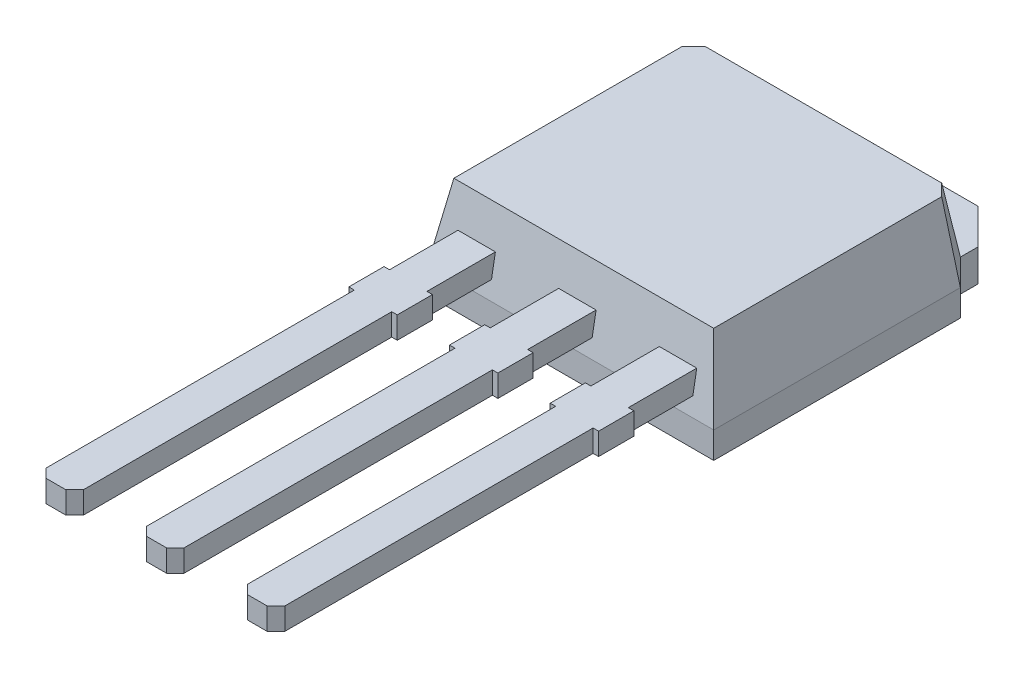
ISO-10303-21;
HEADER;
FILE_DESCRIPTION(('STEP AP214'),'2;1');
FILE_NAME('part.step','',(''),(''),'','','');
FILE_SCHEMA(('AUTOMOTIVE_DESIGN { 1 0 10303 214 1 1 1 1 }'));
ENDSEC;
DATA;
#1=APPLICATION_CONTEXT('core data for automotive mechanical design processes');
#2=APPLICATION_PROTOCOL_DEFINITION('international standard','automotive_design',2000,#1);
#3=PRODUCT_CONTEXT('',#1,'mechanical');
#4=PRODUCT('Part','Part','',(#3));
#5=PRODUCT_RELATED_PRODUCT_CATEGORY('part','',(#4));
#6=PRODUCT_DEFINITION_FORMATION('','',#4);
#7=PRODUCT_DEFINITION_CONTEXT('part definition',#1,'design');
#8=PRODUCT_DEFINITION('design','',#6,#7);
#9=PRODUCT_DEFINITION_SHAPE('','',#8);
#10=(LENGTH_UNIT() NAMED_UNIT(*) SI_UNIT(.MILLI.,.METRE.));
#11=(NAMED_UNIT(*) PLANE_ANGLE_UNIT() SI_UNIT($,.RADIAN.));
#12=(NAMED_UNIT(*) SI_UNIT($,.STERADIAN.) SOLID_ANGLE_UNIT());
#13=UNCERTAINTY_MEASURE_WITH_UNIT(LENGTH_MEASURE(1.E-05),#10,'distance_accuracy_value','');
#14=(GEOMETRIC_REPRESENTATION_CONTEXT(3) GLOBAL_UNCERTAINTY_ASSIGNED_CONTEXT((#13)) GLOBAL_UNIT_ASSIGNED_CONTEXT((#10,
#11,#12)) REPRESENTATION_CONTEXT('',''));
#15=CARTESIAN_POINT('',(0.,0.,0.));
#16=DIRECTION('',(0.,0.,1.));
#17=DIRECTION('',(1.,0.,0.));
#18=AXIS2_PLACEMENT_3D('',#15,#16,#17);
#19=CARTESIAN_POINT('',(-2.65000000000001,0.73,-6.2));
#20=DIRECTION('',(0.,0.,-1.));
#21=DIRECTION('',(-1.,0.,0.));
#22=AXIS2_PLACEMENT_3D('',#19,#20,#21);
#23=PLANE('',#22);
#24=DIRECTION('',(1.,0.,0.));
#25=VECTOR('',#24,1.);
#26=CARTESIAN_POINT('',(-2.65000000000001,0.,-6.2));
#27=LINE('',#26,#25);
#28=CARTESIAN_POINT('',(-2.65000000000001,0.,-6.2));
#29=VERTEX_POINT('',#28);
#30=CARTESIAN_POINT('',(-2.5,0.,-6.2));
#31=VERTEX_POINT('',#30);
#32=EDGE_CURVE('E1331',#29,#31,#27,.T.);
#33=ORIENTED_EDGE('',*,*,#32,.T.);
#34=DIRECTION('',(0.,-1.,0.));
#35=VECTOR('',#34,1.);
#36=CARTESIAN_POINT('',(-2.5,0.23,-6.2));
#37=LINE('',#36,#35);
#38=CARTESIAN_POINT('',(-2.5,0.23,-6.2));
#39=VERTEX_POINT('',#38);
#40=EDGE_CURVE('E771',#39,#31,#37,.T.);
#41=ORIENTED_EDGE('',*,*,#40,.F.);
#42=DIRECTION('',(-1.,0.,0.));
#43=VECTOR('',#42,1.);
#44=CARTESIAN_POINT('',(-3.25000000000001,0.23,-6.2));
#45=LINE('',#44,#43);
#46=CARTESIAN_POINT('',(-2.65000000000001,0.23,-6.2));
#47=VERTEX_POINT('',#46);
#48=EDGE_CURVE('E739',#39,#47,#45,.T.);
#49=ORIENTED_EDGE('',*,*,#48,.T.);
#50=DIRECTION('',(0.,-1.,0.));
#51=VECTOR('',#50,1.);
#52=CARTESIAN_POINT('',(-2.65000000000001,0.73,-6.2));
#53=LINE('',#52,#51);
#54=EDGE_CURVE('E1205',#47,#29,#53,.T.);
#55=ORIENTED_EDGE('',*,*,#54,.T.);
#56=EDGE_LOOP('',(#33,#41,#49,#55));
#57=FACE_BOUND('',#56,.T.);
#58=ADVANCED_FACE('F35',(#57),#23,.F.);
#59=CARTESIAN_POINT('',(-3.25000000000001,2.43,0.));
#60=DIRECTION('',(1.,0.,0.));
#61=DIRECTION('',(0.,0.,-1.));
#62=AXIS2_PLACEMENT_3D('',#59,#60,#61);
#63=PLANE('',#62);
#64=DIRECTION('',(0.,-1.,0.));
#65=VECTOR('',#64,1.);
#66=CARTESIAN_POINT('',(-3.25000000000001,2.43,0.));
#67=LINE('',#66,#65);
#68=CARTESIAN_POINT('',(-3.25000000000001,0.729999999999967,0.));
#69=VERTEX_POINT('',#68);
#70=CARTESIAN_POINT('',(-3.25000000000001,0.13,0.));
#71=VERTEX_POINT('',#70);
#72=EDGE_CURVE('E847',#69,#71,#67,.T.);
#73=ORIENTED_EDGE('',*,*,#72,.F.);
#74=DIRECTION('',(0.,0.,-1.));
#75=VECTOR('',#74,1.);
#76=CARTESIAN_POINT('',(-3.25000000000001,0.729999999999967,0.));
#77=LINE('',#76,#75);
#78=CARTESIAN_POINT('',(-3.25000000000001,0.729999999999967,-5.6));
#79=VERTEX_POINT('',#78);
#80=EDGE_CURVE('E904',#69,#79,#77,.T.);
#81=ORIENTED_EDGE('',*,*,#80,.T.);
#82=DIRECTION('',(0.,-1.,0.));
#83=VECTOR('',#82,1.);
#84=CARTESIAN_POINT('',(-3.25000000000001,2.43,-5.6));
#85=LINE('',#84,#83);
#86=CARTESIAN_POINT('',(-3.25000000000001,0.13,-5.6));
#87=VERTEX_POINT('',#86);
#88=EDGE_CURVE('E868',#79,#87,#85,.T.);
#89=ORIENTED_EDGE('',*,*,#88,.T.);
#90=DIRECTION('',(0.,0.,1.));
#91=VECTOR('',#90,1.);
#92=CARTESIAN_POINT('',(-3.25000000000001,0.13,0.));
#93=LINE('',#92,#91);
#94=EDGE_CURVE('E1222',#87,#71,#93,.T.);
#95=ORIENTED_EDGE('',*,*,#94,.T.);
#96=EDGE_LOOP('',(#73,#81,#89,#95));
#97=FACE_BOUND('',#96,.T.);
#98=ADVANCED_FACE('F1155',(#97),#63,.F.);
#99=CARTESIAN_POINT('',(-3.25000000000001,2.43,0.));
#100=DIRECTION('',(0.,0.,-1.));
#101=DIRECTION('',(-1.,0.,0.));
#102=AXIS2_PLACEMENT_3D('',#99,#100,#101);
#103=PLANE('',#102);
#104=DIRECTION('',(0.,-1.,0.));
#105=VECTOR('',#104,1.);
#106=CARTESIAN_POINT('',(3.25000000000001,2.43,0.));
#107=LINE('',#106,#105);
#108=CARTESIAN_POINT('',(3.25000000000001,0.729999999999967,0.));
#109=VERTEX_POINT('',#108);
#110=CARTESIAN_POINT('',(3.25000000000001,0.13,0.));
#111=VERTEX_POINT('',#110);
#112=EDGE_CURVE('E1237',#109,#111,#107,.T.);
#113=ORIENTED_EDGE('',*,*,#112,.F.);
#114=DIRECTION('',(-1.,0.,0.));
#115=VECTOR('',#114,1.);
#116=CARTESIAN_POINT('',(-3.25000000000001,0.729999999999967,0.));
#117=LINE('',#116,#115);
#118=EDGE_CURVE('E912',#109,#69,#117,.T.);
#119=ORIENTED_EDGE('',*,*,#118,.T.);
#120=ORIENTED_EDGE('',*,*,#72,.T.);
#121=DIRECTION('',(1.,0.,0.));
#122=VECTOR('',#121,1.);
#123=CARTESIAN_POINT('',(-3.25000000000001,0.13,0.));
#124=LINE('',#123,#122);
#125=EDGE_CURVE('E1226',#71,#111,#124,.T.);
#126=ORIENTED_EDGE('',*,*,#125,.T.);
#127=EDGE_LOOP('',(#113,#119,#120,#126));
#128=FACE_BOUND('',#127,.T.);
#129=ADVANCED_FACE('F1162',(#128),#103,.F.);
#130=CARTESIAN_POINT('',(3.25000000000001,2.43,0.));
#131=DIRECTION('',(-1.,0.,0.));
#132=DIRECTION('',(0.,0.,1.));
#133=AXIS2_PLACEMENT_3D('',#130,#131,#132);
#134=PLANE('',#133);
#135=DIRECTION('',(0.,-1.,0.));
#136=VECTOR('',#135,1.);
#137=CARTESIAN_POINT('',(3.24999999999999,2.43,-5.6));
#138=LINE('',#137,#136);
#139=CARTESIAN_POINT('',(3.24999999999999,0.729999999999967,-5.6));
#140=VERTEX_POINT('',#139);
#141=CARTESIAN_POINT('',(3.24999999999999,0.13,-5.6));
#142=VERTEX_POINT('',#141);
#143=EDGE_CURVE('E1235',#140,#142,#138,.T.);
#144=ORIENTED_EDGE('',*,*,#143,.F.);
#145=DIRECTION('',(0.,0.,1.));
#146=VECTOR('',#145,1.);
#147=CARTESIAN_POINT('',(3.25000000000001,0.729999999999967,0.));
#148=LINE('',#147,#146);
#149=EDGE_CURVE('E909',#140,#109,#148,.T.);
#150=ORIENTED_EDGE('',*,*,#149,.T.);
#151=ORIENTED_EDGE('',*,*,#112,.T.);
#152=DIRECTION('',(0.,0.,-1.));
#153=VECTOR('',#152,1.);
#154=CARTESIAN_POINT('',(3.25000000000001,0.13,0.));
#155=LINE('',#154,#153);
#156=EDGE_CURVE('E1230',#111,#142,#155,.T.);
#157=ORIENTED_EDGE('',*,*,#156,.T.);
#158=EDGE_LOOP('',(#144,#150,#151,#157));
#159=FACE_BOUND('',#158,.T.);
#160=ADVANCED_FACE('F2069',(#159),#134,.F.);
#161=CARTESIAN_POINT('',(2.64999999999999,2.43,-6.2));
#162=DIRECTION('',(-0.707106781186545,0.,0.70710678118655));
#163=DIRECTION('',(0.70710678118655,0.,0.707106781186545));
#164=AXIS2_PLACEMENT_3D('',#161,#162,#163);
#165=PLANE('',#164);
#166=DIRECTION('',(0.,-1.,0.));
#167=VECTOR('',#166,1.);
#168=CARTESIAN_POINT('',(2.64999999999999,0.73,-6.2));
#169=LINE('',#168,#167);
#170=CARTESIAN_POINT('',(2.64999999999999,0.73,-6.2));
#171=VERTEX_POINT('',#170);
#172=CARTESIAN_POINT('',(2.64999999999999,0.23,-6.2));
#173=VERTEX_POINT('',#172);
#174=EDGE_CURVE('E1190',#171,#173,#169,.T.);
#175=ORIENTED_EDGE('',*,*,#174,.F.);
#176=DIRECTION('',(0.70710678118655,0.,0.707106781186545));
#177=VECTOR('',#176,1.);
#178=CARTESIAN_POINT('',(2.64999999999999,0.729999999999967,-6.2));
#179=LINE('',#178,#177);
#180=EDGE_CURVE('E899',#171,#140,#179,.T.);
#181=ORIENTED_EDGE('',*,*,#180,.T.);
#182=ORIENTED_EDGE('',*,*,#143,.T.);
#183=DIRECTION('',(-0.70710678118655,0.,-0.707106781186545));
#184=VECTOR('',#183,1.);
#185=CARTESIAN_POINT('',(2.64999999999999,0.13,-6.2));
#186=LINE('',#185,#184);
#187=CARTESIAN_POINT('',(2.69999999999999,0.13,-6.15));
#188=VERTEX_POINT('',#187);
#189=EDGE_CURVE('E861',#142,#188,#186,.T.);
#190=ORIENTED_EDGE('',*,*,#189,.T.);
#191=DIRECTION('',(0.,1.,0.));
#192=VECTOR('',#191,1.);
#193=CARTESIAN_POINT('',(2.69999999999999,2.43,-6.15));
#194=LINE('',#193,#192);
#195=CARTESIAN_POINT('',(2.69999999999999,0.23,-6.15));
#196=VERTEX_POINT('',#195);
#197=EDGE_CURVE('E826',#188,#196,#194,.T.);
#198=ORIENTED_EDGE('',*,*,#197,.T.);
#199=DIRECTION('',(-0.70710678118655,0.,-0.707106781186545));
#200=VECTOR('',#199,1.);
#201=CARTESIAN_POINT('',(2.64999999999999,0.23,-6.2));
#202=LINE('',#201,#200);
#203=EDGE_CURVE('E822',#196,#173,#202,.T.);
#204=ORIENTED_EDGE('',*,*,#203,.T.);
#205=EDGE_LOOP('',(#175,#181,#182,#190,#198,#204));
#206=FACE_BOUND('',#205,.T.);
#207=ADVANCED_FACE('F1199',(#206),#165,.F.);
#208=CARTESIAN_POINT('',(-3.25000000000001,2.43,-5.6));
#209=DIRECTION('',(0.707106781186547,0.,0.707106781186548));
#210=DIRECTION('',(0.707106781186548,0.,-0.707106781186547));
#211=AXIS2_PLACEMENT_3D('',#208,#209,#210);
#212=PLANE('',#211);
#213=ORIENTED_EDGE('',*,*,#88,.F.);
#214=DIRECTION('',(0.707106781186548,0.,-0.707106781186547));
#215=VECTOR('',#214,1.);
#216=CARTESIAN_POINT('',(-3.25000000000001,0.729999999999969,-5.6));
#217=LINE('',#216,#215);
#218=CARTESIAN_POINT('',(-2.65000000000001,0.73,-6.2));
#219=VERTEX_POINT('',#218);
#220=EDGE_CURVE('E895',#79,#219,#217,.T.);
#221=ORIENTED_EDGE('',*,*,#220,.T.);
#222=EDGE_CURVE('E1208',#219,#47,#53,.T.);
#223=ORIENTED_EDGE('',*,*,#222,.T.);
#224=DIRECTION('',(-0.707106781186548,0.,0.707106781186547));
#225=VECTOR('',#224,1.);
#226=CARTESIAN_POINT('',(-3.25000000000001,0.23,-5.6));
#227=LINE('',#226,#225);
#228=CARTESIAN_POINT('',(-2.70000000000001,0.23,-6.15));
#229=VERTEX_POINT('',#228);
#230=EDGE_CURVE('E795',#47,#229,#227,.T.);
#231=ORIENTED_EDGE('',*,*,#230,.T.);
#232=DIRECTION('',(0.,-1.,0.));
#233=VECTOR('',#232,1.);
#234=CARTESIAN_POINT('',(-2.70000000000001,2.43,-6.15));
#235=LINE('',#234,#233);
#236=CARTESIAN_POINT('',(-2.70000000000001,0.13,-6.15));
#237=VERTEX_POINT('',#236);
#238=EDGE_CURVE('E830',#229,#237,#235,.T.);
#239=ORIENTED_EDGE('',*,*,#238,.T.);
#240=DIRECTION('',(-0.707106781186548,0.,0.707106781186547));
#241=VECTOR('',#240,1.);
#242=CARTESIAN_POINT('',(-3.25000000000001,0.13,-5.6));
#243=LINE('',#242,#241);
#244=EDGE_CURVE('E864',#237,#87,#243,.T.);
#245=ORIENTED_EDGE('',*,*,#244,.T.);
#246=EDGE_LOOP('',(#213,#221,#223,#231,#239,#245));
#247=FACE_BOUND('',#246,.T.);
#248=ADVANCED_FACE('F1257',(#247),#212,.F.);
#249=CARTESIAN_POINT('',(-3.25000000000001,2.43,0.));
#250=DIRECTION('',(0.,-1.,0.));
#251=DIRECTION('',(0.,0.,-1.));
#252=AXIS2_PLACEMENT_3D('',#249,#250,#251);
#253=PLANE('',#252);
#254=DIRECTION('',(-0.70710678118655,0.,-0.707106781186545));
#255=VECTOR('',#254,1.);
#256=CARTESIAN_POINT('',(2.5880405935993,2.43,-5.83804059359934));
#257=LINE('',#256,#255);
#258=CARTESIAN_POINT('',(2.9502441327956,2.43,-5.47583705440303));
#259=VERTEX_POINT('',#258);
#260=CARTESIAN_POINT('',(2.68159481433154,2.43,-5.74448637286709));
#261=VERTEX_POINT('',#260);
#262=EDGE_CURVE('E888',#259,#261,#257,.T.);
#263=ORIENTED_EDGE('',*,*,#262,.T.);
#264=DIRECTION('',(-1.,0.,0.));
#265=VECTOR('',#264,1.);
#266=CARTESIAN_POINT('',(-3.25000000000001,2.43,-5.74448637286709));
#267=LINE('',#266,#265);
#268=CARTESIAN_POINT('',(-2.68159481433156,2.43,-5.74448637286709));
#269=VERTEX_POINT('',#268);
#270=EDGE_CURVE('E915',#261,#269,#267,.T.);
#271=ORIENTED_EDGE('',*,*,#270,.T.);
#272=DIRECTION('',(-0.707106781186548,0.,0.707106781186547));
#273=VECTOR('',#272,1.);
#274=CARTESIAN_POINT('',(-5.83804059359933,2.43,-2.58804059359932));
#275=LINE('',#274,#273);
#276=CARTESIAN_POINT('',(-2.95024413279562,2.43,-5.47583705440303));
#277=VERTEX_POINT('',#276);
#278=EDGE_CURVE('E892',#269,#277,#275,.T.);
#279=ORIENTED_EDGE('',*,*,#278,.T.);
#280=DIRECTION('',(0.,0.,1.));
#281=VECTOR('',#280,1.);
#282=CARTESIAN_POINT('',(-2.95024413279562,2.43,0.));
#283=LINE('',#282,#281);
#284=CARTESIAN_POINT('',(-2.95024413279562,2.43,-0.299755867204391));
#285=VERTEX_POINT('',#284);
#286=EDGE_CURVE('E885',#277,#285,#283,.T.);
#287=ORIENTED_EDGE('',*,*,#286,.T.);
#288=DIRECTION('',(1.,0.,0.));
#289=VECTOR('',#288,1.);
#290=CARTESIAN_POINT('',(-3.25000000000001,2.43,-0.299755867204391));
#291=LINE('',#290,#289);
#292=CARTESIAN_POINT('',(2.95024413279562,2.43,-0.299755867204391));
#293=VERTEX_POINT('',#292);
#294=EDGE_CURVE('E879',#285,#293,#291,.T.);
#295=ORIENTED_EDGE('',*,*,#294,.T.);
#296=DIRECTION('',(0.,0.,-1.));
#297=VECTOR('',#296,1.);
#298=CARTESIAN_POINT('',(2.95024413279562,2.43,0.));
#299=LINE('',#298,#297);
#300=EDGE_CURVE('E882',#293,#259,#299,.T.);
#301=ORIENTED_EDGE('',*,*,#300,.T.);
#302=EDGE_LOOP('',(#263,#271,#279,#287,#295,#301));
#303=FACE_BOUND('',#302,.T.);
#304=ADVANCED_FACE('F1178',(#303),#253,.F.);
#305=CARTESIAN_POINT('',(-3.25000000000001,0.13,0.));
#306=DIRECTION('',(0.,-1.,0.));
#307=DIRECTION('',(0.,0.,-1.));
#308=AXIS2_PLACEMENT_3D('',#305,#306,#307);
#309=PLANE('',#308);
#310=DIRECTION('',(-1.,0.,0.));
#311=VECTOR('',#310,1.);
#312=CARTESIAN_POINT('',(-3.25000000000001,0.13,-6.15));
#313=LINE('',#312,#311);
#314=CARTESIAN_POINT('',(-2.55,0.13,-6.15));
#315=VERTEX_POINT('',#314);
#316=EDGE_CURVE('E772',#315,#237,#313,.T.);
#317=ORIENTED_EDGE('',*,*,#316,.F.);
#318=DIRECTION('',(0.,0.,1.));
#319=VECTOR('',#318,1.);
#320=CARTESIAN_POINT('',(-2.55,0.13,-6.2));
#321=LINE('',#320,#319);
#322=CARTESIAN_POINT('',(-2.55,0.13,-2.14));
#323=VERTEX_POINT('',#322);
#324=EDGE_CURVE('E740',#323,#315,#321,.F.);
#325=ORIENTED_EDGE('',*,*,#324,.F.);
#326=DIRECTION('',(1.,0.,0.));
#327=VECTOR('',#326,1.);
#328=CARTESIAN_POINT('',(-2.5,0.13,-2.14));
#329=LINE('',#328,#327);
#330=CARTESIAN_POINT('',(2.55,0.13,-2.14));
#331=VERTEX_POINT('',#330);
#332=EDGE_CURVE('E785',#331,#323,#329,.F.);
#333=ORIENTED_EDGE('',*,*,#332,.F.);
#334=DIRECTION('',(0.,0.,1.));
#335=VECTOR('',#334,1.);
#336=CARTESIAN_POINT('',(2.55,0.13,-6.2));
#337=LINE('',#336,#335);
#338=CARTESIAN_POINT('',(2.55,0.13,-6.15));
#339=VERTEX_POINT('',#338);
#340=EDGE_CURVE('E780',#339,#331,#337,.T.);
#341=ORIENTED_EDGE('',*,*,#340,.F.);
#342=DIRECTION('',(-1.,0.,0.));
#343=VECTOR('',#342,1.);
#344=CARTESIAN_POINT('',(3.25000000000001,0.13,-6.15));
#345=LINE('',#344,#343);
#346=EDGE_CURVE('E777',#188,#339,#345,.T.);
#347=ORIENTED_EDGE('',*,*,#346,.F.);
#348=ORIENTED_EDGE('',*,*,#189,.F.);
#349=ORIENTED_EDGE('',*,*,#156,.F.);
#350=ORIENTED_EDGE('',*,*,#125,.F.);
#351=ORIENTED_EDGE('',*,*,#94,.F.);
#352=ORIENTED_EDGE('',*,*,#244,.F.);
#353=EDGE_LOOP('',(#317,#325,#333,#341,#347,#348,#349,#350,#351,#352));
#354=FACE_BOUND('',#353,.T.);
#355=ADVANCED_FACE('F1170',(#354),#309,.T.);
#356=CARTESIAN_POINT('',(2.64999999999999,0.,-6.2));
#357=VERTEX_POINT('',#356);
#358=EDGE_CURVE('E1182',#173,#357,#169,.T.);
#359=ORIENTED_EDGE('',*,*,#358,.F.);
#360=DIRECTION('',(-1.,0.,0.));
#361=VECTOR('',#360,1.);
#362=CARTESIAN_POINT('',(3.25000000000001,0.23,-6.2));
#363=LINE('',#362,#361);
#364=CARTESIAN_POINT('',(2.5,0.23,-6.2));
#365=VERTEX_POINT('',#364);
#366=EDGE_CURVE('E753',#173,#365,#363,.T.);
#367=ORIENTED_EDGE('',*,*,#366,.T.);
#368=DIRECTION('',(0.,-1.,0.));
#369=VECTOR('',#368,1.);
#370=CARTESIAN_POINT('',(2.5,0.23,-6.2));
#371=LINE('',#370,#369);
#372=CARTESIAN_POINT('',(2.5,0.,-6.2));
#373=VERTEX_POINT('',#372);
#374=EDGE_CURVE('E806',#365,#373,#371,.T.);
#375=ORIENTED_EDGE('',*,*,#374,.T.);
#376=EDGE_CURVE('E1185',#373,#357,#27,.T.);
#377=ORIENTED_EDGE('',*,*,#376,.T.);
#378=EDGE_LOOP('',(#359,#367,#375,#377));
#379=FACE_BOUND('',#378,.T.);
#380=ADVANCED_FACE('F1158',(#379),#23,.F.);
#381=CARTESIAN_POINT('',(-2.65000000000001,0.73,-6.2));
#382=DIRECTION('',(1.,0.,0.));
#383=DIRECTION('',(0.,0.,-1.));
#384=AXIS2_PLACEMENT_3D('',#381,#382,#383);
#385=PLANE('',#384);
#386=DIRECTION('',(0.,0.,1.));
#387=VECTOR('',#386,1.);
#388=CARTESIAN_POINT('',(-2.65000000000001,0.,-6.2));
#389=LINE('',#388,#387);
#390=CARTESIAN_POINT('',(-2.65000000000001,0.,-6.6));
#391=VERTEX_POINT('',#390);
#392=EDGE_CURVE('E834',#391,#29,#389,.T.);
#393=ORIENTED_EDGE('',*,*,#392,.T.);
#394=ORIENTED_EDGE('',*,*,#54,.F.);
#395=ORIENTED_EDGE('',*,*,#222,.F.);
#396=DIRECTION('',(0.,0.,1.));
#397=VECTOR('',#396,1.);
#398=CARTESIAN_POINT('',(-2.65000000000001,0.73,-6.2));
#399=LINE('',#398,#397);
#400=CARTESIAN_POINT('',(-2.65000000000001,0.73,-6.6));
#401=VERTEX_POINT('',#400);
#402=EDGE_CURVE('E846',#401,#219,#399,.T.);
#403=ORIENTED_EDGE('',*,*,#402,.F.);
#404=DIRECTION('',(0.,-1.,0.));
#405=VECTOR('',#404,1.);
#406=CARTESIAN_POINT('',(-2.65000000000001,0.73,-6.6));
#407=LINE('',#406,#405);
#408=EDGE_CURVE('E1298',#401,#391,#407,.T.);
#409=ORIENTED_EDGE('',*,*,#408,.T.);
#410=EDGE_LOOP('',(#393,#394,#395,#403,#409));
#411=FACE_BOUND('',#410,.T.);
#412=ADVANCED_FACE('F1169',(#411),#385,.F.);
#413=CARTESIAN_POINT('',(2.64999999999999,0.73,-6.2));
#414=DIRECTION('',(-1.,0.,0.));
#415=DIRECTION('',(0.,0.,1.));
#416=AXIS2_PLACEMENT_3D('',#413,#414,#415);
#417=PLANE('',#416);
#418=DIRECTION('',(0.,0.,-1.));
#419=VECTOR('',#418,1.);
#420=CARTESIAN_POINT('',(2.64999999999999,0.,-6.2));
#421=LINE('',#420,#419);
#422=CARTESIAN_POINT('',(2.65,0.,-6.6));
#423=VERTEX_POINT('',#422);
#424=EDGE_CURVE('E1326',#357,#423,#421,.T.);
#425=ORIENTED_EDGE('',*,*,#424,.T.);
#426=DIRECTION('',(0.,-1.,0.));
#427=VECTOR('',#426,1.);
#428=CARTESIAN_POINT('',(2.65,0.73,-6.6));
#429=LINE('',#428,#427);
#430=CARTESIAN_POINT('',(2.65,0.73,-6.6));
#431=VERTEX_POINT('',#430);
#432=EDGE_CURVE('E1191',#431,#423,#429,.T.);
#433=ORIENTED_EDGE('',*,*,#432,.F.);
#434=DIRECTION('',(0.,0.,-1.));
#435=VECTOR('',#434,1.);
#436=CARTESIAN_POINT('',(2.64999999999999,0.73,-6.2));
#437=LINE('',#436,#435);
#438=EDGE_CURVE('E845',#171,#431,#437,.T.);
#439=ORIENTED_EDGE('',*,*,#438,.F.);
#440=ORIENTED_EDGE('',*,*,#174,.T.);
#441=ORIENTED_EDGE('',*,*,#358,.T.);
#442=EDGE_LOOP('',(#425,#433,#439,#440,#441));
#443=FACE_BOUND('',#442,.T.);
#444=ADVANCED_FACE('F1176',(#443),#417,.F.);
#445=CARTESIAN_POINT('',(1.85,0.73,-7.4));
#446=DIRECTION('',(-0.707106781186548,0.,0.707106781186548));
#447=DIRECTION('',(0.707106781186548,0.,0.707106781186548));
#448=AXIS2_PLACEMENT_3D('',#445,#446,#447);
#449=PLANE('',#448);
#450=DIRECTION('',(-0.707106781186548,0.,-0.707106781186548));
#451=VECTOR('',#450,1.);
#452=CARTESIAN_POINT('',(1.85,0.,-7.4));
#453=LINE('',#452,#451);
#454=CARTESIAN_POINT('',(1.85,0.,-7.4));
#455=VERTEX_POINT('',#454);
#456=EDGE_CURVE('E1323',#423,#455,#453,.T.);
#457=ORIENTED_EDGE('',*,*,#456,.T.);
#458=DIRECTION('',(0.,-1.,0.));
#459=VECTOR('',#458,1.);
#460=CARTESIAN_POINT('',(1.85,0.73,-7.4));
#461=LINE('',#460,#459);
#462=CARTESIAN_POINT('',(1.85,0.73,-7.4));
#463=VERTEX_POINT('',#462);
#464=EDGE_CURVE('E1307',#463,#455,#461,.T.);
#465=ORIENTED_EDGE('',*,*,#464,.F.);
#466=DIRECTION('',(-0.707106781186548,0.,-0.707106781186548));
#467=VECTOR('',#466,1.);
#468=CARTESIAN_POINT('',(1.85,0.73,-7.4));
#469=LINE('',#468,#467);
#470=EDGE_CURVE('E837',#431,#463,#469,.T.);
#471=ORIENTED_EDGE('',*,*,#470,.F.);
#472=ORIENTED_EDGE('',*,*,#432,.T.);
#473=EDGE_LOOP('',(#457,#465,#471,#472));
#474=FACE_BOUND('',#473,.T.);
#475=ADVANCED_FACE('F1322',(#474),#449,.F.);
#476=CARTESIAN_POINT('',(-1.85000000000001,0.73,-7.4));
#477=DIRECTION('',(0.,0.,1.));
#478=DIRECTION('',(1.,0.,0.));
#479=AXIS2_PLACEMENT_3D('',#476,#477,#478);
#480=PLANE('',#479);
#481=DIRECTION('',(-1.,0.,0.));
#482=VECTOR('',#481,1.);
#483=CARTESIAN_POINT('',(-1.85000000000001,0.,-7.4));
#484=LINE('',#483,#482);
#485=CARTESIAN_POINT('',(-1.85000000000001,0.,-7.4));
#486=VERTEX_POINT('',#485);
#487=EDGE_CURVE('E1327',#455,#486,#484,.T.);
#488=ORIENTED_EDGE('',*,*,#487,.T.);
#489=DIRECTION('',(0.,-1.,0.));
#490=VECTOR('',#489,1.);
#491=CARTESIAN_POINT('',(-1.85000000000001,0.73,-7.4));
#492=LINE('',#491,#490);
#493=CARTESIAN_POINT('',(-1.85000000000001,0.73,-7.4));
#494=VERTEX_POINT('',#493);
#495=EDGE_CURVE('E1304',#494,#486,#492,.T.);
#496=ORIENTED_EDGE('',*,*,#495,.F.);
#497=DIRECTION('',(-1.,0.,0.));
#498=VECTOR('',#497,1.);
#499=CARTESIAN_POINT('',(-1.85000000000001,0.73,-7.4));
#500=LINE('',#499,#498);
#501=EDGE_CURVE('E1293',#463,#494,#500,.T.);
#502=ORIENTED_EDGE('',*,*,#501,.F.);
#503=ORIENTED_EDGE('',*,*,#464,.T.);
#504=EDGE_LOOP('',(#488,#496,#502,#503));
#505=FACE_BOUND('',#504,.T.);
#506=ADVANCED_FACE('F1338',(#505),#480,.F.);
#507=CARTESIAN_POINT('',(-2.65000000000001,0.73,-6.6));
#508=DIRECTION('',(0.707106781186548,0.,0.707106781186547));
#509=DIRECTION('',(0.707106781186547,0.,-0.707106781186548));
#510=AXIS2_PLACEMENT_3D('',#507,#508,#509);
#511=PLANE('',#510);
#512=DIRECTION('',(-0.707106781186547,0.,0.707106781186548));
#513=VECTOR('',#512,1.);
#514=CARTESIAN_POINT('',(-2.65000000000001,0.,-6.6));
#515=LINE('',#514,#513);
#516=EDGE_CURVE('E856',#486,#391,#515,.T.);
#517=ORIENTED_EDGE('',*,*,#516,.T.);
#518=ORIENTED_EDGE('',*,*,#408,.F.);
#519=DIRECTION('',(-0.707106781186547,0.,0.707106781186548));
#520=VECTOR('',#519,1.);
#521=CARTESIAN_POINT('',(-2.65000000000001,0.73,-6.6));
#522=LINE('',#521,#520);
#523=EDGE_CURVE('E1290',#494,#401,#522,.T.);
#524=ORIENTED_EDGE('',*,*,#523,.F.);
#525=ORIENTED_EDGE('',*,*,#495,.T.);
#526=EDGE_LOOP('',(#517,#518,#524,#525));
#527=FACE_BOUND('',#526,.T.);
#528=ADVANCED_FACE('F1300',(#527),#511,.F.);
#529=CARTESIAN_POINT('',(-2.65000000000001,0.73,-7.4));
#530=DIRECTION('',(0.,-1.,0.));
#531=DIRECTION('',(0.,0.,-1.));
#532=AXIS2_PLACEMENT_3D('',#529,#530,#531);
#533=PLANE('',#532);
#534=ORIENTED_EDGE('',*,*,#402,.T.);
#535=DIRECTION('',(1.,0.,0.));
#536=VECTOR('',#535,1.);
#537=CARTESIAN_POINT('',(-2.65000000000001,0.73,-6.2));
#538=LINE('',#537,#536);
#539=EDGE_CURVE('E840',#219,#171,#538,.T.);
#540=ORIENTED_EDGE('',*,*,#539,.T.);
#541=ORIENTED_EDGE('',*,*,#438,.T.);
#542=ORIENTED_EDGE('',*,*,#470,.T.);
#543=ORIENTED_EDGE('',*,*,#501,.T.);
#544=ORIENTED_EDGE('',*,*,#523,.T.);
#545=EDGE_LOOP('',(#534,#540,#541,#542,#543,#544));
#546=FACE_BOUND('',#545,.T.);
#547=ADVANCED_FACE('F1288',(#546),#533,.F.);
#548=CARTESIAN_POINT('',(-2.65000000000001,0.,-7.4));
#549=DIRECTION('',(0.,-1.,0.));
#550=DIRECTION('',(0.,0.,-1.));
#551=AXIS2_PLACEMENT_3D('',#548,#549,#550);
#552=PLANE('',#551);
#553=ORIENTED_EDGE('',*,*,#392,.F.);
#554=ORIENTED_EDGE('',*,*,#516,.F.);
#555=ORIENTED_EDGE('',*,*,#487,.F.);
#556=ORIENTED_EDGE('',*,*,#456,.F.);
#557=ORIENTED_EDGE('',*,*,#424,.F.);
#558=ORIENTED_EDGE('',*,*,#376,.F.);
#559=DIRECTION('',(0.,0.,1.));
#560=VECTOR('',#559,1.);
#561=CARTESIAN_POINT('',(2.5,0.,0.));
#562=LINE('',#561,#560);
#563=CARTESIAN_POINT('',(2.5,0.,-2.19));
#564=VERTEX_POINT('',#563);
#565=EDGE_CURVE('E781',#373,#564,#562,.T.);
#566=ORIENTED_EDGE('',*,*,#565,.T.);
#567=DIRECTION('',(-1.,0.,0.));
#568=VECTOR('',#567,1.);
#569=CARTESIAN_POINT('',(-3.25000000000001,0.,-2.19));
#570=LINE('',#569,#568);
#571=CARTESIAN_POINT('',(-2.5,0.,-2.19));
#572=VERTEX_POINT('',#571);
#573=EDGE_CURVE('E872',#564,#572,#570,.T.);
#574=ORIENTED_EDGE('',*,*,#573,.T.);
#575=DIRECTION('',(0.,0.,-1.));
#576=VECTOR('',#575,1.);
#577=CARTESIAN_POINT('',(-2.5,0.,0.));
#578=LINE('',#577,#576);
#579=EDGE_CURVE('E775',#572,#31,#578,.T.);
#580=ORIENTED_EDGE('',*,*,#579,.T.);
#581=ORIENTED_EDGE('',*,*,#32,.F.);
#582=EDGE_LOOP('',(#553,#554,#555,#556,#557,#558,#566,#574,#580,#581));
#583=FACE_BOUND('',#582,.T.);
#584=ADVANCED_FACE('F1325',(#583),#552,.T.);
#585=CARTESIAN_POINT('',(-3.25000000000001,0.23,-6.15));
#586=DIRECTION('',(0.,0.,1.));
#587=DIRECTION('',(1.,0.,0.));
#588=AXIS2_PLACEMENT_3D('',#585,#586,#587);
#589=PLANE('',#588);
#590=DIRECTION('',(-1.,0.,0.));
#591=VECTOR('',#590,1.);
#592=CARTESIAN_POINT('',(-3.25000000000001,0.23,-6.15));
#593=LINE('',#592,#591);
#594=CARTESIAN_POINT('',(-2.55,0.23,-6.15));
#595=VERTEX_POINT('',#594);
#596=EDGE_CURVE('E735',#595,#229,#593,.T.);
#597=ORIENTED_EDGE('',*,*,#596,.F.);
#598=DIRECTION('',(0.,-1.,0.));
#599=VECTOR('',#598,1.);
#600=CARTESIAN_POINT('',(-2.55,0.23,-6.15));
#601=LINE('',#600,#599);
#602=EDGE_CURVE('E792',#595,#315,#601,.T.);
#603=ORIENTED_EDGE('',*,*,#602,.T.);
#604=ORIENTED_EDGE('',*,*,#316,.T.);
#605=ORIENTED_EDGE('',*,*,#238,.F.);
#606=EDGE_LOOP('',(#597,#603,#604,#605));
#607=FACE_BOUND('',#606,.T.);
#608=ADVANCED_FACE('F1262',(#607),#589,.F.);
#609=CARTESIAN_POINT('',(3.25000000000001,0.23,-6.15));
#610=DIRECTION('',(0.,0.,1.));
#611=DIRECTION('',(1.,0.,0.));
#612=AXIS2_PLACEMENT_3D('',#609,#610,#611);
#613=PLANE('',#612);
#614=ORIENTED_EDGE('',*,*,#346,.T.);
#615=DIRECTION('',(0.,-1.,0.));
#616=VECTOR('',#615,1.);
#617=CARTESIAN_POINT('',(2.55,0.23,-6.15));
#618=LINE('',#617,#616);
#619=CARTESIAN_POINT('',(2.55,0.23,-6.15));
#620=VERTEX_POINT('',#619);
#621=EDGE_CURVE('E802',#620,#339,#618,.T.);
#622=ORIENTED_EDGE('',*,*,#621,.F.);
#623=DIRECTION('',(-1.,0.,0.));
#624=VECTOR('',#623,1.);
#625=CARTESIAN_POINT('',(3.25000000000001,0.23,-6.15));
#626=LINE('',#625,#624);
#627=EDGE_CURVE('E756',#196,#620,#626,.T.);
#628=ORIENTED_EDGE('',*,*,#627,.F.);
#629=ORIENTED_EDGE('',*,*,#197,.F.);
#630=EDGE_LOOP('',(#614,#622,#628,#629));
#631=FACE_BOUND('',#630,.T.);
#632=ADVANCED_FACE('F1276',(#631),#613,.F.);
#633=CARTESIAN_POINT('',(-3.25000000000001,0.23,-6.15));
#634=DIRECTION('',(0.,1.,0.));
#635=DIRECTION('',(0.,0.,1.));
#636=AXIS2_PLACEMENT_3D('',#633,#634,#635);
#637=PLANE('',#636);
#638=ORIENTED_EDGE('',*,*,#627,.T.);
#639=DIRECTION('',(0.,0.,1.));
#640=VECTOR('',#639,1.);
#641=CARTESIAN_POINT('',(2.55,0.23,-6.2));
#642=LINE('',#641,#640);
#643=CARTESIAN_POINT('',(2.55,0.23,-2.14));
#644=VERTEX_POINT('',#643);
#645=EDGE_CURVE('E759',#620,#644,#642,.T.);
#646=ORIENTED_EDGE('',*,*,#645,.T.);
#647=DIRECTION('',(1.,0.,0.));
#648=VECTOR('',#647,1.);
#649=CARTESIAN_POINT('',(-2.5,0.23,-2.14));
#650=LINE('',#649,#648);
#651=CARTESIAN_POINT('',(-2.55,0.23,-2.14));
#652=VERTEX_POINT('',#651);
#653=EDGE_CURVE('E763',#644,#652,#650,.F.);
#654=ORIENTED_EDGE('',*,*,#653,.T.);
#655=DIRECTION('',(0.,0.,1.));
#656=VECTOR('',#655,1.);
#657=CARTESIAN_POINT('',(-2.55,0.23,-6.2));
#658=LINE('',#657,#656);
#659=EDGE_CURVE('E767',#652,#595,#658,.F.);
#660=ORIENTED_EDGE('',*,*,#659,.T.);
#661=ORIENTED_EDGE('',*,*,#596,.T.);
#662=ORIENTED_EDGE('',*,*,#230,.F.);
#663=ORIENTED_EDGE('',*,*,#48,.F.);
#664=DIRECTION('',(0.,0.,-1.));
#665=VECTOR('',#664,1.);
#666=CARTESIAN_POINT('',(-2.5,0.23,-6.2));
#667=LINE('',#666,#665);
#668=CARTESIAN_POINT('',(-2.5,0.23,-2.19));
#669=VERTEX_POINT('',#668);
#670=EDGE_CURVE('E744',#669,#39,#667,.T.);
#671=ORIENTED_EDGE('',*,*,#670,.F.);
#672=DIRECTION('',(-1.,0.,0.));
#673=VECTOR('',#672,1.);
#674=CARTESIAN_POINT('',(-2.5,0.23,-2.19));
#675=LINE('',#674,#673);
#676=CARTESIAN_POINT('',(2.5,0.23,-2.19));
#677=VERTEX_POINT('',#676);
#678=EDGE_CURVE('E747',#677,#669,#675,.T.);
#679=ORIENTED_EDGE('',*,*,#678,.F.);
#680=DIRECTION('',(0.,0.,1.));
#681=VECTOR('',#680,1.);
#682=CARTESIAN_POINT('',(2.5,0.23,-6.2));
#683=LINE('',#682,#681);
#684=EDGE_CURVE('E750',#365,#677,#683,.T.);
#685=ORIENTED_EDGE('',*,*,#684,.F.);
#686=ORIENTED_EDGE('',*,*,#366,.F.);
#687=ORIENTED_EDGE('',*,*,#203,.F.);
#688=EDGE_LOOP('',(#638,#646,#654,#660,#661,#662,#663,#671,#679,#685,#686,#687));
#689=FACE_BOUND('',#688,.T.);
#690=ADVANCED_FACE('F1195',(#689),#637,.F.);
#691=CARTESIAN_POINT('',(-2.55,0.23,-6.2));
#692=DIRECTION('',(-1.,0.,0.));
#693=DIRECTION('',(0.,0.,1.));
#694=AXIS2_PLACEMENT_3D('',#691,#692,#693);
#695=PLANE('',#694);
#696=ORIENTED_EDGE('',*,*,#324,.T.);
#697=ORIENTED_EDGE('',*,*,#602,.F.);
#698=ORIENTED_EDGE('',*,*,#659,.F.);
#699=DIRECTION('',(0.,-1.,0.));
#700=VECTOR('',#699,1.);
#701=CARTESIAN_POINT('',(-2.55,0.23,-2.14));
#702=LINE('',#701,#700);
#703=EDGE_CURVE('E796',#652,#323,#702,.T.);
#704=ORIENTED_EDGE('',*,*,#703,.T.);
#705=EDGE_LOOP('',(#696,#697,#698,#704));
#706=FACE_BOUND('',#705,.T.);
#707=ADVANCED_FACE('F1265',(#706),#695,.F.);
#708=CARTESIAN_POINT('',(-2.5,0.23,-2.14));
#709=DIRECTION('',(0.,0.,1.));
#710=DIRECTION('',(1.,0.,0.));
#711=AXIS2_PLACEMENT_3D('',#708,#709,#710);
#712=PLANE('',#711);
#713=ORIENTED_EDGE('',*,*,#332,.T.);
#714=ORIENTED_EDGE('',*,*,#703,.F.);
#715=ORIENTED_EDGE('',*,*,#653,.F.);
#716=DIRECTION('',(0.,-1.,0.));
#717=VECTOR('',#716,1.);
#718=CARTESIAN_POINT('',(2.55,0.23,-2.14));
#719=LINE('',#718,#717);
#720=EDGE_CURVE('E799',#644,#331,#719,.T.);
#721=ORIENTED_EDGE('',*,*,#720,.T.);
#722=EDGE_LOOP('',(#713,#714,#715,#721));
#723=FACE_BOUND('',#722,.T.);
#724=ADVANCED_FACE('F1268',(#723),#712,.F.);
#725=CARTESIAN_POINT('',(2.55,0.23,-6.2));
#726=DIRECTION('',(1.,0.,0.));
#727=DIRECTION('',(0.,0.,-1.));
#728=AXIS2_PLACEMENT_3D('',#725,#726,#727);
#729=PLANE('',#728);
#730=ORIENTED_EDGE('',*,*,#340,.T.);
#731=ORIENTED_EDGE('',*,*,#720,.F.);
#732=ORIENTED_EDGE('',*,*,#645,.F.);
#733=ORIENTED_EDGE('',*,*,#621,.T.);
#734=EDGE_LOOP('',(#730,#731,#732,#733));
#735=FACE_BOUND('',#734,.T.);
#736=ADVANCED_FACE('F1272',(#735),#729,.F.);
#737=CARTESIAN_POINT('',(2.5,0.23,-6.2));
#738=DIRECTION('',(1.,0.,0.));
#739=DIRECTION('',(0.,0.,-1.));
#740=AXIS2_PLACEMENT_3D('',#737,#738,#739);
#741=PLANE('',#740);
#742=ORIENTED_EDGE('',*,*,#565,.F.);
#743=ORIENTED_EDGE('',*,*,#374,.F.);
#744=ORIENTED_EDGE('',*,*,#684,.T.);
#745=DIRECTION('',(0.,-1.,0.));
#746=VECTOR('',#745,1.);
#747=CARTESIAN_POINT('',(2.5,0.23,-2.19));
#748=LINE('',#747,#746);
#749=EDGE_CURVE('E810',#677,#564,#748,.T.);
#750=ORIENTED_EDGE('',*,*,#749,.T.);
#751=EDGE_LOOP('',(#742,#743,#744,#750));
#752=FACE_BOUND('',#751,.T.);
#753=ADVANCED_FACE('F1353',(#752),#741,.T.);
#754=CARTESIAN_POINT('',(-2.5,0.23,-2.19));
#755=DIRECTION('',(0.,0.,1.));
#756=DIRECTION('',(1.,0.,0.));
#757=AXIS2_PLACEMENT_3D('',#754,#755,#756);
#758=PLANE('',#757);
#759=ORIENTED_EDGE('',*,*,#573,.F.);
#760=ORIENTED_EDGE('',*,*,#749,.F.);
#761=ORIENTED_EDGE('',*,*,#678,.T.);
#762=DIRECTION('',(0.,-1.,0.));
#763=VECTOR('',#762,1.);
#764=CARTESIAN_POINT('',(-2.5,0.23,-2.19));
#765=LINE('',#764,#763);
#766=EDGE_CURVE('E813',#669,#572,#765,.T.);
#767=ORIENTED_EDGE('',*,*,#766,.T.);
#768=EDGE_LOOP('',(#759,#760,#761,#767));
#769=FACE_BOUND('',#768,.T.);
#770=ADVANCED_FACE('F1349',(#769),#758,.T.);
#771=CARTESIAN_POINT('',(-2.5,0.23,-6.2));
#772=DIRECTION('',(-1.,0.,0.));
#773=DIRECTION('',(0.,0.,1.));
#774=AXIS2_PLACEMENT_3D('',#771,#772,#773);
#775=PLANE('',#774);
#776=ORIENTED_EDGE('',*,*,#579,.F.);
#777=ORIENTED_EDGE('',*,*,#766,.F.);
#778=ORIENTED_EDGE('',*,*,#670,.T.);
#779=ORIENTED_EDGE('',*,*,#40,.T.);
#780=EDGE_LOOP('',(#776,#777,#778,#779));
#781=FACE_BOUND('',#780,.T.);
#782=ADVANCED_FACE('F1346',(#781),#775,.T.);
#783=CARTESIAN_POINT('',(2.5880405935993,2.43,-5.83804059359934));
#784=DIRECTION('',(-0.696364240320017,-0.173648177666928,0.696364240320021));
#785=DIRECTION('',(0.70710678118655,0.,0.707106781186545));
#786=AXIS2_PLACEMENT_3D('',#783,#784,#785);
#787=PLANE('',#786);
#788=ORIENTED_EDGE('',*,*,#180,.F.);
#789=DIRECTION('',(0.0179490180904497,0.965770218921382,0.25877735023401));
#790=VECTOR('',#789,1.);
#791=CARTESIAN_POINT('',(2.68113013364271,2.40499725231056,-5.75118583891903));
#792=LINE('',#791,#790);
#793=EDGE_CURVE('E936',#171,#261,#792,.T.);
#794=ORIENTED_EDGE('',*,*,#793,.T.);
#795=ORIENTED_EDGE('',*,*,#262,.F.);
#796=DIRECTION('',(-0.17320072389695,0.982270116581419,0.0717420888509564));
#797=VECTOR('',#796,1.);
#798=CARTESIAN_POINT('',(2.88220257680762,2.81588283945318,-5.44765331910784));
#799=LINE('',#798,#797);
#800=EDGE_CURVE('E776',#140,#259,#799,.T.);
#801=ORIENTED_EDGE('',*,*,#800,.F.);
#802=EDGE_LOOP('',(#788,#794,#795,#801));
#803=FACE_BOUND('',#802,.T.);
#804=ADVANCED_FACE('F1367',(#803),#787,.F.);
#805=CARTESIAN_POINT('',(2.95024413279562,2.43,0.));
#806=DIRECTION('',(-0.984807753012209,-0.173648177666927,0.));
#807=DIRECTION('',(0.173648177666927,-0.984807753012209,0.));
#808=AXIS2_PLACEMENT_3D('',#805,#806,#807);
#809=PLANE('',#808);
#810=ORIENTED_EDGE('',*,*,#800,.T.);
#811=ORIENTED_EDGE('',*,*,#300,.F.);
#812=DIRECTION('',(-0.171087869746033,0.970287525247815,-0.171087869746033));
#813=VECTOR('',#812,1.);
#814=CARTESIAN_POINT('',(2.76875641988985,3.45926796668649,-0.481243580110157));
#815=LINE('',#814,#813);
#816=EDGE_CURVE('E923',#109,#293,#815,.T.);
#817=ORIENTED_EDGE('',*,*,#816,.F.);
#818=ORIENTED_EDGE('',*,*,#149,.F.);
#819=EDGE_LOOP('',(#810,#811,#817,#818));
#820=FACE_BOUND('',#819,.T.);
#821=ADVANCED_FACE('F1446',(#820),#809,.F.);
#822=CARTESIAN_POINT('',(-3.25000000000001,2.43,-0.299755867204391));
#823=DIRECTION('',(0.,-0.173648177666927,-0.984807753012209));
#824=DIRECTION('',(0.,0.984807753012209,-0.173648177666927));
#825=AXIS2_PLACEMENT_3D('',#822,#823,#824);
#826=PLANE('',#825);
#827=DIRECTION('',(1.,0.,0.));
#828=VECTOR('',#827,1.);
#829=CARTESIAN_POINT('',(-3.25000000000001,1.6,-0.153404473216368));
#830=LINE('',#829,#828);
#831=CARTESIAN_POINT('',(2.71099999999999,1.6,-0.153404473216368));
#832=VERTEX_POINT('',#831);
#833=CARTESIAN_POINT('',(1.86099999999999,1.6,-0.153404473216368));
#834=VERTEX_POINT('',#833);
#835=EDGE_CURVE('E12',#832,#834,#830,.F.);
#836=ORIENTED_EDGE('',*,*,#835,.F.);
#837=DIRECTION('',(0.,0.984807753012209,-0.173648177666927));
#838=VECTOR('',#837,1.);
#839=CARTESIAN_POINT('',(2.71099999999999,2.43,-0.299755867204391));
#840=LINE('',#839,#838);
#841=CARTESIAN_POINT('',(2.71099999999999,1.1,-0.0652409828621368));
#842=VERTEX_POINT('',#841);
#843=EDGE_CURVE('E977',#832,#842,#840,.F.);
#844=ORIENTED_EDGE('',*,*,#843,.T.);
#845=DIRECTION('',(1.,0.,0.));
#846=VECTOR('',#845,1.);
#847=CARTESIAN_POINT('',(-3.25000000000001,1.1,-0.0652409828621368));
#848=LINE('',#847,#846);
#849=CARTESIAN_POINT('',(1.86099999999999,1.1,-0.0652409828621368));
#850=VERTEX_POINT('',#849);
#851=EDGE_CURVE('E973',#842,#850,#848,.F.);
#852=ORIENTED_EDGE('',*,*,#851,.T.);
#853=DIRECTION('',(0.,-0.984807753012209,0.173648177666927));
#854=VECTOR('',#853,1.);
#855=CARTESIAN_POINT('',(1.86099999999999,2.43,-0.299755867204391));
#856=LINE('',#855,#854);
#857=EDGE_CURVE('E44',#850,#834,#856,.F.);
#858=ORIENTED_EDGE('',*,*,#857,.T.);
#859=EDGE_LOOP('',(#836,#844,#852,#858));
#860=FACE_BOUND('',#859,.T.);
#861=DIRECTION('',(1.,0.,0.));
#862=VECTOR('',#861,1.);
#863=CARTESIAN_POINT('',(-3.25000000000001,1.6,-0.153404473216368));
#864=LINE('',#863,#862);
#865=CARTESIAN_POINT('',(0.424999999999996,1.6,-0.153404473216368));
#866=VERTEX_POINT('',#865);
#867=CARTESIAN_POINT('',(-0.425000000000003,1.6,-0.153404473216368));
#868=VERTEX_POINT('',#867);
#869=EDGE_CURVE('E970',#866,#868,#864,.F.);
#870=ORIENTED_EDGE('',*,*,#869,.F.);
#871=DIRECTION('',(0.,0.984807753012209,-0.173648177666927));
#872=VECTOR('',#871,1.);
#873=CARTESIAN_POINT('',(0.424999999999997,2.43,-0.299755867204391));
#874=LINE('',#873,#872);
#875=CARTESIAN_POINT('',(0.424999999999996,1.1,-0.0652409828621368));
#876=VERTEX_POINT('',#875);
#877=EDGE_CURVE('E962',#866,#876,#874,.F.);
#878=ORIENTED_EDGE('',*,*,#877,.T.);
#879=DIRECTION('',(1.,0.,0.));
#880=VECTOR('',#879,1.);
#881=CARTESIAN_POINT('',(-3.25000000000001,1.1,-0.0652409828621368));
#882=LINE('',#881,#880);
#883=CARTESIAN_POINT('',(-0.425000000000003,1.1,-0.0652409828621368));
#884=VERTEX_POINT('',#883);
#885=EDGE_CURVE('E958',#876,#884,#882,.F.);
#886=ORIENTED_EDGE('',*,*,#885,.T.);
#887=DIRECTION('',(0.,-0.984807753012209,0.173648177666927));
#888=VECTOR('',#887,1.);
#889=CARTESIAN_POINT('',(-0.425000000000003,2.43,-0.299755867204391));
#890=LINE('',#889,#888);
#891=EDGE_CURVE('E966',#884,#868,#890,.F.);
#892=ORIENTED_EDGE('',*,*,#891,.T.);
#893=EDGE_LOOP('',(#870,#878,#886,#892));
#894=FACE_BOUND('',#893,.T.);
#895=DIRECTION('',(1.,0.,0.));
#896=VECTOR('',#895,1.);
#897=CARTESIAN_POINT('',(-3.25000000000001,1.6,-0.153404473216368));
#898=LINE('',#897,#896);
#899=CARTESIAN_POINT('',(-1.861,1.6,-0.153404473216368));
#900=VERTEX_POINT('',#899);
#901=CARTESIAN_POINT('',(-2.711,1.6,-0.153404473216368));
#902=VERTEX_POINT('',#901);
#903=EDGE_CURVE('E955',#900,#902,#898,.F.);
#904=ORIENTED_EDGE('',*,*,#903,.F.);
#905=DIRECTION('',(0.,0.984807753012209,-0.173648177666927));
#906=VECTOR('',#905,1.);
#907=CARTESIAN_POINT('',(-1.861,2.43,-0.299755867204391));
#908=LINE('',#907,#906);
#909=CARTESIAN_POINT('',(-1.861,1.1,-0.0652409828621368));
#910=VERTEX_POINT('',#909);
#911=EDGE_CURVE('E947',#900,#910,#908,.F.);
#912=ORIENTED_EDGE('',*,*,#911,.T.);
#913=DIRECTION('',(1.,0.,0.));
#914=VECTOR('',#913,1.);
#915=CARTESIAN_POINT('',(-3.25000000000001,1.1,-0.0652409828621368));
#916=LINE('',#915,#914);
#917=CARTESIAN_POINT('',(-2.711,1.1,-0.0652409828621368));
#918=VERTEX_POINT('',#917);
#919=EDGE_CURVE('E941',#910,#918,#916,.F.);
#920=ORIENTED_EDGE('',*,*,#919,.T.);
#921=DIRECTION('',(0.,-0.984807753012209,0.173648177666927));
#922=VECTOR('',#921,1.);
#923=CARTESIAN_POINT('',(-2.711,2.43,-0.299755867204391));
#924=LINE('',#923,#922);
#925=EDGE_CURVE('E951',#918,#902,#924,.F.);
#926=ORIENTED_EDGE('',*,*,#925,.T.);
#927=EDGE_LOOP('',(#904,#912,#920,#926));
#928=FACE_BOUND('',#927,.T.);
#929=ORIENTED_EDGE('',*,*,#816,.T.);
#930=ORIENTED_EDGE('',*,*,#294,.F.);
#931=DIRECTION('',(-0.171087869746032,-0.970287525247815,0.171087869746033));
#932=VECTOR('',#931,1.);
#933=CARTESIAN_POINT('',(-2.95901830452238,2.3802391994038,-0.290981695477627));
#934=LINE('',#933,#932);
#935=EDGE_CURVE('E919',#69,#285,#934,.F.);
#936=ORIENTED_EDGE('',*,*,#935,.F.);
#937=ORIENTED_EDGE('',*,*,#118,.F.);
#938=EDGE_LOOP('',(#929,#930,#936,#937));
#939=FACE_BOUND('',#938,.T.);
#940=ADVANCED_FACE('F982',(#860,#894,#928,#939),#826,.F.);
#941=CARTESIAN_POINT('',(-2.95024413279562,2.43,0.));
#942=DIRECTION('',(0.984807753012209,-0.173648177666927,0.));
#943=DIRECTION('',(0.173648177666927,0.984807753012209,0.));
#944=AXIS2_PLACEMENT_3D('',#941,#942,#943);
#945=PLANE('',#944);
#946=ORIENTED_EDGE('',*,*,#935,.T.);
#947=ORIENTED_EDGE('',*,*,#286,.F.);
#948=DIRECTION('',(-0.17320072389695,-0.982270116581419,-0.0717420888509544));
#949=VECTOR('',#948,1.);
#950=CARTESIAN_POINT('',(-2.88220257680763,2.81588283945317,-5.44765331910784));
#951=LINE('',#950,#949);
#952=EDGE_CURVE('E734',#79,#277,#951,.F.);
#953=ORIENTED_EDGE('',*,*,#952,.F.);
#954=ORIENTED_EDGE('',*,*,#80,.F.);
#955=EDGE_LOOP('',(#946,#947,#953,#954));
#956=FACE_BOUND('',#955,.T.);
#957=ADVANCED_FACE('F1465',(#956),#945,.F.);
#958=CARTESIAN_POINT('',(-5.83804059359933,2.43,-2.58804059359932));
#959=DIRECTION('',(0.696364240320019,-0.173648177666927,0.69636424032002));
#960=DIRECTION('',(0.707106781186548,0.,-0.707106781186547));
#961=AXIS2_PLACEMENT_3D('',#958,#959,#960);
#962=PLANE('',#961);
#963=ORIENTED_EDGE('',*,*,#278,.F.);
#964=DIRECTION('',(0.0179490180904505,-0.965770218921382,-0.25877735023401));
#965=VECTOR('',#964,1.);
#966=CARTESIAN_POINT('',(-2.69727277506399,3.27357302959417,-5.51845166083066));
#967=LINE('',#966,#965);
#968=EDGE_CURVE('E933',#269,#219,#967,.T.);
#969=ORIENTED_EDGE('',*,*,#968,.T.);
#970=ORIENTED_EDGE('',*,*,#220,.F.);
#971=ORIENTED_EDGE('',*,*,#952,.T.);
#972=EDGE_LOOP('',(#963,#969,#970,#971));
#973=FACE_BOUND('',#972,.T.);
#974=ADVANCED_FACE('F1474',(#973),#962,.F.);
#975=CARTESIAN_POINT('',(-3.25000000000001,2.43,-5.74448637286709));
#976=DIRECTION('',(0.,-0.258819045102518,0.965925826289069));
#977=DIRECTION('',(0.,-0.965925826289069,-0.258819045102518));
#978=AXIS2_PLACEMENT_3D('',#975,#976,#977);
#979=PLANE('',#978);
#980=ORIENTED_EDGE('',*,*,#793,.F.);
#981=ORIENTED_EDGE('',*,*,#539,.F.);
#982=ORIENTED_EDGE('',*,*,#968,.F.);
#983=ORIENTED_EDGE('',*,*,#270,.F.);
#984=EDGE_LOOP('',(#980,#981,#982,#983));
#985=FACE_BOUND('',#984,.T.);
#986=ADVANCED_FACE('F37',(#985),#979,.F.);
#987=CARTESIAN_POINT('',(-2.711,1.6,-0.299755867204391));
#988=DIRECTION('',(1.,0.,0.));
#989=DIRECTION('',(0.,0.,-1.));
#990=AXIS2_PLACEMENT_3D('',#987,#988,#989);
#991=PLANE('',#990);
#992=ORIENTED_EDGE('',*,*,#925,.F.);
#993=DIRECTION('',(0.,0.,1.));
#994=VECTOR('',#993,1.);
#995=CARTESIAN_POINT('',(-2.711,1.1,-0.299755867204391));
#996=LINE('',#995,#994);
#997=CARTESIAN_POINT('',(-2.711,1.1,1.4));
#998=VERTEX_POINT('',#997);
#999=EDGE_CURVE('E606',#918,#998,#996,.T.);
#1000=ORIENTED_EDGE('',*,*,#999,.T.);
#1001=DIRECTION('',(0.,-1.,0.));
#1002=VECTOR('',#1001,1.);
#1003=CARTESIAN_POINT('',(-2.711,1.6,1.4));
#1004=LINE('',#1003,#1002);
#1005=CARTESIAN_POINT('',(-2.711,1.6,1.4));
#1006=VERTEX_POINT('',#1005);
#1007=EDGE_CURVE('E730',#1006,#998,#1004,.T.);
#1008=ORIENTED_EDGE('',*,*,#1007,.F.);
#1009=DIRECTION('',(0.,0.,1.));
#1010=VECTOR('',#1009,1.);
#1011=CARTESIAN_POINT('',(-2.711,1.6,-0.299755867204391));
#1012=LINE('',#1011,#1010);
#1013=EDGE_CURVE('E607',#902,#1006,#1012,.T.);
#1014=ORIENTED_EDGE('',*,*,#1013,.F.);
#1015=EDGE_LOOP('',(#992,#1000,#1008,#1014));
#1016=FACE_BOUND('',#1015,.T.);
#1017=ADVANCED_FACE('F1490',(#1016),#991,.F.);
#1018=CARTESIAN_POINT('',(-2.836,1.6,1.4));
#1019=DIRECTION('',(0.,0.,1.));
#1020=DIRECTION('',(1.,0.,0.));
#1021=AXIS2_PLACEMENT_3D('',#1018,#1019,#1020);
#1022=PLANE('',#1021);
#1023=DIRECTION('',(-1.,0.,0.));
#1024=VECTOR('',#1023,1.);
#1025=CARTESIAN_POINT('',(-2.836,1.1,1.4));
#1026=LINE('',#1025,#1024);
#1027=CARTESIAN_POINT('',(-2.836,1.1,1.4));
#1028=VERTEX_POINT('',#1027);
#1029=EDGE_CURVE('E651',#998,#1028,#1026,.T.);
#1030=ORIENTED_EDGE('',*,*,#1029,.T.);
#1031=DIRECTION('',(0.,-1.,0.));
#1032=VECTOR('',#1031,1.);
#1033=CARTESIAN_POINT('',(-2.836,1.6,1.4));
#1034=LINE('',#1033,#1032);
#1035=CARTESIAN_POINT('',(-2.836,1.6,1.4));
#1036=VERTEX_POINT('',#1035);
#1037=EDGE_CURVE('E726',#1036,#1028,#1034,.T.);
#1038=ORIENTED_EDGE('',*,*,#1037,.F.);
#1039=DIRECTION('',(-1.,0.,0.));
#1040=VECTOR('',#1039,1.);
#1041=CARTESIAN_POINT('',(-2.836,1.6,1.4));
#1042=LINE('',#1041,#1040);
#1043=EDGE_CURVE('E610',#1006,#1036,#1042,.T.);
#1044=ORIENTED_EDGE('',*,*,#1043,.F.);
#1045=ORIENTED_EDGE('',*,*,#1007,.T.);
#1046=EDGE_LOOP('',(#1030,#1038,#1044,#1045));
#1047=FACE_BOUND('',#1046,.T.);
#1048=ADVANCED_FACE('F1496',(#1047),#1022,.F.);
#1049=CARTESIAN_POINT('',(-2.836,1.6,1.4));
#1050=DIRECTION('',(1.,0.,0.));
#1051=DIRECTION('',(0.,0.,-1.));
#1052=AXIS2_PLACEMENT_3D('',#1049,#1050,#1051);
#1053=PLANE('',#1052);
#1054=DIRECTION('',(0.,0.,1.));
#1055=VECTOR('',#1054,1.);
#1056=CARTESIAN_POINT('',(-2.836,1.1,1.4));
#1057=LINE('',#1056,#1055);
#1058=CARTESIAN_POINT('',(-2.836,1.1,2.2));
#1059=VERTEX_POINT('',#1058);
#1060=EDGE_CURVE('E654',#1028,#1059,#1057,.T.);
#1061=ORIENTED_EDGE('',*,*,#1060,.T.);
#1062=DIRECTION('',(0.,-1.,0.));
#1063=VECTOR('',#1062,1.);
#1064=CARTESIAN_POINT('',(-2.836,1.6,2.2));
#1065=LINE('',#1064,#1063);
#1066=CARTESIAN_POINT('',(-2.836,1.6,2.2));
#1067=VERTEX_POINT('',#1066);
#1068=EDGE_CURVE('E722',#1067,#1059,#1065,.T.);
#1069=ORIENTED_EDGE('',*,*,#1068,.F.);
#1070=DIRECTION('',(0.,0.,1.));
#1071=VECTOR('',#1070,1.);
#1072=CARTESIAN_POINT('',(-2.836,1.6,1.4));
#1073=LINE('',#1072,#1071);
#1074=EDGE_CURVE('E614',#1036,#1067,#1073,.T.);
#1075=ORIENTED_EDGE('',*,*,#1074,.F.);
#1076=ORIENTED_EDGE('',*,*,#1037,.T.);
#1077=EDGE_LOOP('',(#1061,#1069,#1075,#1076));
#1078=FACE_BOUND('',#1077,.T.);
#1079=ADVANCED_FACE('F1505',(#1078),#1053,.F.);
#1080=CARTESIAN_POINT('',(-2.836,1.6,2.2));
#1081=DIRECTION('',(0.,0.,-1.));
#1082=DIRECTION('',(-1.,0.,0.));
#1083=AXIS2_PLACEMENT_3D('',#1080,#1081,#1082);
#1084=PLANE('',#1083);
#1085=DIRECTION('',(1.,0.,0.));
#1086=VECTOR('',#1085,1.);
#1087=CARTESIAN_POINT('',(-2.836,1.1,2.2));
#1088=LINE('',#1087,#1086);
#1089=CARTESIAN_POINT('',(-2.711,1.1,2.2));
#1090=VERTEX_POINT('',#1089);
#1091=EDGE_CURVE('E657',#1059,#1090,#1088,.T.);
#1092=ORIENTED_EDGE('',*,*,#1091,.T.);
#1093=DIRECTION('',(0.,-1.,0.));
#1094=VECTOR('',#1093,1.);
#1095=CARTESIAN_POINT('',(-2.711,1.6,2.2));
#1096=LINE('',#1095,#1094);
#1097=CARTESIAN_POINT('',(-2.711,1.6,2.2));
#1098=VERTEX_POINT('',#1097);
#1099=EDGE_CURVE('E718',#1098,#1090,#1096,.T.);
#1100=ORIENTED_EDGE('',*,*,#1099,.F.);
#1101=DIRECTION('',(1.,0.,0.));
#1102=VECTOR('',#1101,1.);
#1103=CARTESIAN_POINT('',(-2.836,1.6,2.2));
#1104=LINE('',#1103,#1102);
#1105=EDGE_CURVE('E617',#1067,#1098,#1104,.T.);
#1106=ORIENTED_EDGE('',*,*,#1105,.F.);
#1107=ORIENTED_EDGE('',*,*,#1068,.T.);
#1108=EDGE_LOOP('',(#1092,#1100,#1106,#1107));
#1109=FACE_BOUND('',#1108,.T.);
#1110=ADVANCED_FACE('F1514',(#1109),#1084,.F.);
#1111=CARTESIAN_POINT('',(-2.711,1.6,2.2));
#1112=DIRECTION('',(1.,0.,0.));
#1113=DIRECTION('',(0.,0.,-1.));
#1114=AXIS2_PLACEMENT_3D('',#1111,#1112,#1113);
#1115=PLANE('',#1114);
#1116=DIRECTION('',(0.,0.,1.));
#1117=VECTOR('',#1116,1.);
#1118=CARTESIAN_POINT('',(-2.711,1.1,2.2));
#1119=LINE('',#1118,#1117);
#1120=CARTESIAN_POINT('',(-2.71099999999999,1.1,9.2));
#1121=VERTEX_POINT('',#1120);
#1122=EDGE_CURVE('E660',#1090,#1121,#1119,.T.);
#1123=ORIENTED_EDGE('',*,*,#1122,.T.);
#1124=DIRECTION('',(0.,-1.,0.));
#1125=VECTOR('',#1124,1.);
#1126=CARTESIAN_POINT('',(-2.71099999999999,1.6,9.2));
#1127=LINE('',#1126,#1125);
#1128=CARTESIAN_POINT('',(-2.71099999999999,1.6,9.2));
#1129=VERTEX_POINT('',#1128);
#1130=EDGE_CURVE('E714',#1129,#1121,#1127,.T.);
#1131=ORIENTED_EDGE('',*,*,#1130,.F.);
#1132=DIRECTION('',(0.,0.,1.));
#1133=VECTOR('',#1132,1.);
#1134=CARTESIAN_POINT('',(-2.711,1.6,2.2));
#1135=LINE('',#1134,#1133);
#1136=EDGE_CURVE('E620',#1098,#1129,#1135,.T.);
#1137=ORIENTED_EDGE('',*,*,#1136,.F.);
#1138=ORIENTED_EDGE('',*,*,#1099,.T.);
#1139=EDGE_LOOP('',(#1123,#1131,#1137,#1138));
#1140=FACE_BOUND('',#1139,.T.);
#1141=ADVANCED_FACE('F1523',(#1140),#1115,.F.);
#1142=CARTESIAN_POINT('',(-2.71099999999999,1.6,9.2));
#1143=DIRECTION('',(0.707106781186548,0.,-0.707106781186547));
#1144=DIRECTION('',(-0.707106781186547,0.,-0.707106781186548));
#1145=AXIS2_PLACEMENT_3D('',#1142,#1143,#1144);
#1146=PLANE('',#1145);
#1147=DIRECTION('',(0.707106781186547,0.,0.707106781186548));
#1148=VECTOR('',#1147,1.);
#1149=CARTESIAN_POINT('',(-2.71099999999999,1.1,9.2));
#1150=LINE('',#1149,#1148);
#1151=CARTESIAN_POINT('',(-2.51099999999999,1.1,9.4));
#1152=VERTEX_POINT('',#1151);
#1153=EDGE_CURVE('E663',#1121,#1152,#1150,.T.);
#1154=ORIENTED_EDGE('',*,*,#1153,.T.);
#1155=DIRECTION('',(0.,-1.,0.));
#1156=VECTOR('',#1155,1.);
#1157=CARTESIAN_POINT('',(-2.51099999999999,1.6,9.4));
#1158=LINE('',#1157,#1156);
#1159=CARTESIAN_POINT('',(-2.51099999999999,1.6,9.4));
#1160=VERTEX_POINT('',#1159);
#1161=EDGE_CURVE('E710',#1160,#1152,#1158,.T.);
#1162=ORIENTED_EDGE('',*,*,#1161,.F.);
#1163=DIRECTION('',(0.707106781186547,0.,0.707106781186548));
#1164=VECTOR('',#1163,1.);
#1165=CARTESIAN_POINT('',(-2.71099999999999,1.6,9.2));
#1166=LINE('',#1165,#1164);
#1167=EDGE_CURVE('E623',#1129,#1160,#1166,.T.);
#1168=ORIENTED_EDGE('',*,*,#1167,.F.);
#1169=ORIENTED_EDGE('',*,*,#1130,.T.);
#1170=EDGE_LOOP('',(#1154,#1162,#1168,#1169));
#1171=FACE_BOUND('',#1170,.T.);
#1172=ADVANCED_FACE('F1532',(#1171),#1146,.F.);
#1173=CARTESIAN_POINT('',(-2.51099999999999,1.6,9.4));
#1174=DIRECTION('',(0.,0.,-1.));
#1175=DIRECTION('',(-1.,0.,0.));
#1176=AXIS2_PLACEMENT_3D('',#1173,#1174,#1175);
#1177=PLANE('',#1176);
#1178=DIRECTION('',(1.,0.,0.));
#1179=VECTOR('',#1178,1.);
#1180=CARTESIAN_POINT('',(-2.51099999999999,1.1,9.4));
#1181=LINE('',#1180,#1179);
#1182=CARTESIAN_POINT('',(-2.061,1.1,9.4));
#1183=VERTEX_POINT('',#1182);
#1184=EDGE_CURVE('E666',#1152,#1183,#1181,.T.);
#1185=ORIENTED_EDGE('',*,*,#1184,.T.);
#1186=DIRECTION('',(0.,-1.,0.));
#1187=VECTOR('',#1186,1.);
#1188=CARTESIAN_POINT('',(-2.061,1.6,9.4));
#1189=LINE('',#1188,#1187);
#1190=CARTESIAN_POINT('',(-2.061,1.6,9.4));
#1191=VERTEX_POINT('',#1190);
#1192=EDGE_CURVE('E706',#1191,#1183,#1189,.T.);
#1193=ORIENTED_EDGE('',*,*,#1192,.F.);
#1194=DIRECTION('',(1.,0.,0.));
#1195=VECTOR('',#1194,1.);
#1196=CARTESIAN_POINT('',(-2.51099999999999,1.6,9.4));
#1197=LINE('',#1196,#1195);
#1198=EDGE_CURVE('E626',#1160,#1191,#1197,.T.);
#1199=ORIENTED_EDGE('',*,*,#1198,.F.);
#1200=ORIENTED_EDGE('',*,*,#1161,.T.);
#1201=EDGE_LOOP('',(#1185,#1193,#1199,#1200));
#1202=FACE_BOUND('',#1201,.T.);
#1203=ADVANCED_FACE('F1541',(#1202),#1177,.F.);
#1204=CARTESIAN_POINT('',(-2.061,1.6,9.4));
#1205=DIRECTION('',(-0.707106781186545,0.,-0.70710678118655));
#1206=DIRECTION('',(-0.70710678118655,0.,0.707106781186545));
#1207=AXIS2_PLACEMENT_3D('',#1204,#1205,#1206);
#1208=PLANE('',#1207);
#1209=DIRECTION('',(0.70710678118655,0.,-0.707106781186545));
#1210=VECTOR('',#1209,1.);
#1211=CARTESIAN_POINT('',(-2.061,1.1,9.4));
#1212=LINE('',#1211,#1210);
#1213=CARTESIAN_POINT('',(-1.861,1.1,9.2));
#1214=VERTEX_POINT('',#1213);
#1215=EDGE_CURVE('E669',#1183,#1214,#1212,.T.);
#1216=ORIENTED_EDGE('',*,*,#1215,.T.);
#1217=DIRECTION('',(0.,-1.,0.));
#1218=VECTOR('',#1217,1.);
#1219=CARTESIAN_POINT('',(-1.861,1.6,9.2));
#1220=LINE('',#1219,#1218);
#1221=CARTESIAN_POINT('',(-1.861,1.6,9.2));
#1222=VERTEX_POINT('',#1221);
#1223=EDGE_CURVE('E702',#1222,#1214,#1220,.T.);
#1224=ORIENTED_EDGE('',*,*,#1223,.F.);
#1225=DIRECTION('',(0.70710678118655,0.,-0.707106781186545));
#1226=VECTOR('',#1225,1.);
#1227=CARTESIAN_POINT('',(-2.061,1.6,9.4));
#1228=LINE('',#1227,#1226);
#1229=EDGE_CURVE('E629',#1191,#1222,#1228,.T.);
#1230=ORIENTED_EDGE('',*,*,#1229,.F.);
#1231=ORIENTED_EDGE('',*,*,#1192,.T.);
#1232=EDGE_LOOP('',(#1216,#1224,#1230,#1231));
#1233=FACE_BOUND('',#1232,.T.);
#1234=ADVANCED_FACE('F1550',(#1233),#1208,.F.);
#1235=CARTESIAN_POINT('',(-1.861,1.6,2.2));
#1236=DIRECTION('',(-1.,0.,0.));
#1237=DIRECTION('',(0.,0.,1.));
#1238=AXIS2_PLACEMENT_3D('',#1235,#1236,#1237);
#1239=PLANE('',#1238);
#1240=DIRECTION('',(0.,0.,-1.));
#1241=VECTOR('',#1240,1.);
#1242=CARTESIAN_POINT('',(-1.861,1.1,2.2));
#1243=LINE('',#1242,#1241);
#1244=CARTESIAN_POINT('',(-1.861,1.1,2.2));
#1245=VERTEX_POINT('',#1244);
#1246=EDGE_CURVE('E672',#1214,#1245,#1243,.T.);
#1247=ORIENTED_EDGE('',*,*,#1246,.T.);
#1248=DIRECTION('',(0.,-1.,0.));
#1249=VECTOR('',#1248,1.);
#1250=CARTESIAN_POINT('',(-1.861,1.6,2.2));
#1251=LINE('',#1250,#1249);
#1252=CARTESIAN_POINT('',(-1.861,1.6,2.2));
#1253=VERTEX_POINT('',#1252);
#1254=EDGE_CURVE('E698',#1253,#1245,#1251,.T.);
#1255=ORIENTED_EDGE('',*,*,#1254,.F.);
#1256=DIRECTION('',(0.,0.,-1.));
#1257=VECTOR('',#1256,1.);
#1258=CARTESIAN_POINT('',(-1.861,1.6,2.2));
#1259=LINE('',#1258,#1257);
#1260=EDGE_CURVE('E632',#1222,#1253,#1259,.T.);
#1261=ORIENTED_EDGE('',*,*,#1260,.F.);
#1262=ORIENTED_EDGE('',*,*,#1223,.T.);
#1263=EDGE_LOOP('',(#1247,#1255,#1261,#1262));
#1264=FACE_BOUND('',#1263,.T.);
#1265=ADVANCED_FACE('F1559',(#1264),#1239,.F.);
#1266=CARTESIAN_POINT('',(-1.861,1.6,2.2));
#1267=DIRECTION('',(0.,0.,-1.));
#1268=DIRECTION('',(-1.,0.,0.));
#1269=AXIS2_PLACEMENT_3D('',#1266,#1267,#1268);
#1270=PLANE('',#1269);
#1271=DIRECTION('',(1.,0.,0.));
#1272=VECTOR('',#1271,1.);
#1273=CARTESIAN_POINT('',(-1.861,1.1,2.2));
#1274=LINE('',#1273,#1272);
#1275=CARTESIAN_POINT('',(-1.736,1.1,2.2));
#1276=VERTEX_POINT('',#1275);
#1277=EDGE_CURVE('E675',#1245,#1276,#1274,.T.);
#1278=ORIENTED_EDGE('',*,*,#1277,.T.);
#1279=DIRECTION('',(0.,-1.,0.));
#1280=VECTOR('',#1279,1.);
#1281=CARTESIAN_POINT('',(-1.736,1.6,2.2));
#1282=LINE('',#1281,#1280);
#1283=CARTESIAN_POINT('',(-1.736,1.6,2.2));
#1284=VERTEX_POINT('',#1283);
#1285=EDGE_CURVE('E694',#1284,#1276,#1282,.T.);
#1286=ORIENTED_EDGE('',*,*,#1285,.F.);
#1287=DIRECTION('',(1.,0.,0.));
#1288=VECTOR('',#1287,1.);
#1289=CARTESIAN_POINT('',(-1.861,1.6,2.2));
#1290=LINE('',#1289,#1288);
#1291=EDGE_CURVE('E635',#1253,#1284,#1290,.T.);
#1292=ORIENTED_EDGE('',*,*,#1291,.F.);
#1293=ORIENTED_EDGE('',*,*,#1254,.T.);
#1294=EDGE_LOOP('',(#1278,#1286,#1292,#1293));
#1295=FACE_BOUND('',#1294,.T.);
#1296=ADVANCED_FACE('F1568',(#1295),#1270,.F.);
#1297=CARTESIAN_POINT('',(-1.736,1.6,1.4));
#1298=DIRECTION('',(-1.,0.,0.));
#1299=DIRECTION('',(0.,0.,1.));
#1300=AXIS2_PLACEMENT_3D('',#1297,#1298,#1299);
#1301=PLANE('',#1300);
#1302=DIRECTION('',(0.,0.,-1.));
#1303=VECTOR('',#1302,1.);
#1304=CARTESIAN_POINT('',(-1.736,1.1,1.4));
#1305=LINE('',#1304,#1303);
#1306=CARTESIAN_POINT('',(-1.736,1.1,1.4));
#1307=VERTEX_POINT('',#1306);
#1308=EDGE_CURVE('E678',#1276,#1307,#1305,.T.);
#1309=ORIENTED_EDGE('',*,*,#1308,.T.);
#1310=DIRECTION('',(0.,-1.,0.));
#1311=VECTOR('',#1310,1.);
#1312=CARTESIAN_POINT('',(-1.736,1.6,1.4));
#1313=LINE('',#1312,#1311);
#1314=CARTESIAN_POINT('',(-1.736,1.6,1.4));
#1315=VERTEX_POINT('',#1314);
#1316=EDGE_CURVE('E690',#1315,#1307,#1313,.T.);
#1317=ORIENTED_EDGE('',*,*,#1316,.F.);
#1318=DIRECTION('',(0.,0.,-1.));
#1319=VECTOR('',#1318,1.);
#1320=CARTESIAN_POINT('',(-1.736,1.6,1.4));
#1321=LINE('',#1320,#1319);
#1322=EDGE_CURVE('E638',#1284,#1315,#1321,.T.);
#1323=ORIENTED_EDGE('',*,*,#1322,.F.);
#1324=ORIENTED_EDGE('',*,*,#1285,.T.);
#1325=EDGE_LOOP('',(#1309,#1317,#1323,#1324));
#1326=FACE_BOUND('',#1325,.T.);
#1327=ADVANCED_FACE('F1577',(#1326),#1301,.F.);
#1328=CARTESIAN_POINT('',(-1.861,1.6,1.4));
#1329=DIRECTION('',(0.,0.,1.));
#1330=DIRECTION('',(1.,0.,0.));
#1331=AXIS2_PLACEMENT_3D('',#1328,#1329,#1330);
#1332=PLANE('',#1331);
#1333=DIRECTION('',(-1.,0.,0.));
#1334=VECTOR('',#1333,1.);
#1335=CARTESIAN_POINT('',(-1.861,1.1,1.4));
#1336=LINE('',#1335,#1334);
#1337=CARTESIAN_POINT('',(-1.861,1.1,1.4));
#1338=VERTEX_POINT('',#1337);
#1339=EDGE_CURVE('E681',#1307,#1338,#1336,.T.);
#1340=ORIENTED_EDGE('',*,*,#1339,.T.);
#1341=DIRECTION('',(0.,-1.,0.));
#1342=VECTOR('',#1341,1.);
#1343=CARTESIAN_POINT('',(-1.861,1.6,1.4));
#1344=LINE('',#1343,#1342);
#1345=CARTESIAN_POINT('',(-1.861,1.6,1.4));
#1346=VERTEX_POINT('',#1345);
#1347=EDGE_CURVE('E648',#1346,#1338,#1344,.T.);
#1348=ORIENTED_EDGE('',*,*,#1347,.F.);
#1349=DIRECTION('',(-1.,0.,0.));
#1350=VECTOR('',#1349,1.);
#1351=CARTESIAN_POINT('',(-1.861,1.6,1.4));
#1352=LINE('',#1351,#1350);
#1353=EDGE_CURVE('E641',#1315,#1346,#1352,.T.);
#1354=ORIENTED_EDGE('',*,*,#1353,.F.);
#1355=ORIENTED_EDGE('',*,*,#1316,.T.);
#1356=EDGE_LOOP('',(#1340,#1348,#1354,#1355));
#1357=FACE_BOUND('',#1356,.T.);
#1358=ADVANCED_FACE('F1586',(#1357),#1332,.F.);
#1359=CARTESIAN_POINT('',(-1.861,1.6,-0.299755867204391));
#1360=DIRECTION('',(-1.,0.,0.));
#1361=DIRECTION('',(0.,0.,1.));
#1362=AXIS2_PLACEMENT_3D('',#1359,#1360,#1361);
#1363=PLANE('',#1362);
#1364=ORIENTED_EDGE('',*,*,#911,.F.);
#1365=DIRECTION('',(0.,0.,-1.));
#1366=VECTOR('',#1365,1.);
#1367=CARTESIAN_POINT('',(-1.861,1.6,-0.299755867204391));
#1368=LINE('',#1367,#1366);
#1369=EDGE_CURVE('E644',#1346,#900,#1368,.T.);
#1370=ORIENTED_EDGE('',*,*,#1369,.F.);
#1371=ORIENTED_EDGE('',*,*,#1347,.T.);
#1372=DIRECTION('',(0.,0.,-1.));
#1373=VECTOR('',#1372,1.);
#1374=CARTESIAN_POINT('',(-1.861,1.1,-0.299755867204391));
#1375=LINE('',#1374,#1373);
#1376=EDGE_CURVE('E611',#1338,#910,#1375,.T.);
#1377=ORIENTED_EDGE('',*,*,#1376,.T.);
#1378=EDGE_LOOP('',(#1364,#1370,#1371,#1377));
#1379=FACE_BOUND('',#1378,.T.);
#1380=ADVANCED_FACE('F1595',(#1379),#1363,.F.);
#1381=CARTESIAN_POINT('',(-2.711,1.6,-0.299755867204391));
#1382=DIRECTION('',(0.,1.,0.));
#1383=DIRECTION('',(0.,0.,1.));
#1384=AXIS2_PLACEMENT_3D('',#1381,#1382,#1383);
#1385=PLANE('',#1384);
#1386=ORIENTED_EDGE('',*,*,#1369,.T.);
#1387=ORIENTED_EDGE('',*,*,#903,.T.);
#1388=ORIENTED_EDGE('',*,*,#1013,.T.);
#1389=ORIENTED_EDGE('',*,*,#1043,.T.);
#1390=ORIENTED_EDGE('',*,*,#1074,.T.);
#1391=ORIENTED_EDGE('',*,*,#1105,.T.);
#1392=ORIENTED_EDGE('',*,*,#1136,.T.);
#1393=ORIENTED_EDGE('',*,*,#1167,.T.);
#1394=ORIENTED_EDGE('',*,*,#1198,.T.);
#1395=ORIENTED_EDGE('',*,*,#1229,.T.);
#1396=ORIENTED_EDGE('',*,*,#1260,.T.);
#1397=ORIENTED_EDGE('',*,*,#1291,.T.);
#1398=ORIENTED_EDGE('',*,*,#1322,.T.);
#1399=ORIENTED_EDGE('',*,*,#1353,.T.);
#1400=EDGE_LOOP('',(#1386,#1387,#1388,#1389,#1390,#1391,#1392,#1393,#1394,#1395,#1396,#1397,
#1398,#1399));
#1401=FACE_BOUND('',#1400,.T.);
#1402=ADVANCED_FACE('F1604',(#1401),#1385,.T.);
#1403=CARTESIAN_POINT('',(-2.711,1.1,-0.299755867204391));
#1404=DIRECTION('',(0.,1.,0.));
#1405=DIRECTION('',(0.,0.,1.));
#1406=AXIS2_PLACEMENT_3D('',#1403,#1404,#1405);
#1407=PLANE('',#1406);
#1408=ORIENTED_EDGE('',*,*,#919,.F.);
#1409=ORIENTED_EDGE('',*,*,#1376,.F.);
#1410=ORIENTED_EDGE('',*,*,#1339,.F.);
#1411=ORIENTED_EDGE('',*,*,#1308,.F.);
#1412=ORIENTED_EDGE('',*,*,#1277,.F.);
#1413=ORIENTED_EDGE('',*,*,#1246,.F.);
#1414=ORIENTED_EDGE('',*,*,#1215,.F.);
#1415=ORIENTED_EDGE('',*,*,#1184,.F.);
#1416=ORIENTED_EDGE('',*,*,#1153,.F.);
#1417=ORIENTED_EDGE('',*,*,#1122,.F.);
#1418=ORIENTED_EDGE('',*,*,#1091,.F.);
#1419=ORIENTED_EDGE('',*,*,#1060,.F.);
#1420=ORIENTED_EDGE('',*,*,#1029,.F.);
#1421=ORIENTED_EDGE('',*,*,#999,.F.);
#1422=EDGE_LOOP('',(#1408,#1409,#1410,#1411,#1412,#1413,#1414,#1415,#1416,#1417,#1418,#1419,
#1420,#1421));
#1423=FACE_BOUND('',#1422,.T.);
#1424=ADVANCED_FACE('F1613',(#1423),#1407,.F.);
#1425=CARTESIAN_POINT('',(-0.425000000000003,1.6,-0.299755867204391));
#1426=DIRECTION('',(1.,0.,0.));
#1427=DIRECTION('',(0.,0.,-1.));
#1428=AXIS2_PLACEMENT_3D('',#1425,#1426,#1427);
#1429=PLANE('',#1428);
#1430=ORIENTED_EDGE('',*,*,#891,.F.);
#1431=DIRECTION('',(0.,0.,1.));
#1432=VECTOR('',#1431,1.);
#1433=CARTESIAN_POINT('',(-0.425000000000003,1.1,-0.299755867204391));
#1434=LINE('',#1433,#1432);
#1435=CARTESIAN_POINT('',(-0.425000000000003,1.1,1.4));
#1436=VERTEX_POINT('',#1435);
#1437=EDGE_CURVE('E59',#884,#1436,#1434,.T.);
#1438=ORIENTED_EDGE('',*,*,#1437,.T.);
#1439=DIRECTION('',(0.,-1.,0.));
#1440=VECTOR('',#1439,1.);
#1441=CARTESIAN_POINT('',(-0.425000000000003,1.6,1.4));
#1442=LINE('',#1441,#1440);
#1443=CARTESIAN_POINT('',(-0.425000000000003,1.6,1.4));
#1444=VERTEX_POINT('',#1443);
#1445=EDGE_CURVE('E602',#1444,#1436,#1442,.T.);
#1446=ORIENTED_EDGE('',*,*,#1445,.F.);
#1447=DIRECTION('',(0.,0.,1.));
#1448=VECTOR('',#1447,1.);
#1449=CARTESIAN_POINT('',(-0.425000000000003,1.6,-0.299755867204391));
#1450=LINE('',#1449,#1448);
#1451=EDGE_CURVE('E483',#868,#1444,#1450,.T.);
#1452=ORIENTED_EDGE('',*,*,#1451,.F.);
#1453=EDGE_LOOP('',(#1430,#1438,#1446,#1452));
#1454=FACE_BOUND('',#1453,.T.);
#1455=ADVANCED_FACE('F1622',(#1454),#1429,.F.);
#1456=CARTESIAN_POINT('',(-0.550000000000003,1.6,1.4));
#1457=DIRECTION('',(0.,0.,1.));
#1458=DIRECTION('',(1.,0.,0.));
#1459=AXIS2_PLACEMENT_3D('',#1456,#1457,#1458);
#1460=PLANE('',#1459);
#1461=DIRECTION('',(-1.,0.,0.));
#1462=VECTOR('',#1461,1.);
#1463=CARTESIAN_POINT('',(-0.550000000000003,1.1,1.4));
#1464=LINE('',#1463,#1462);
#1465=CARTESIAN_POINT('',(-0.550000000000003,1.1,1.4));
#1466=VERTEX_POINT('',#1465);
#1467=EDGE_CURVE('E476',#1436,#1466,#1464,.T.);
#1468=ORIENTED_EDGE('',*,*,#1467,.T.);
#1469=DIRECTION('',(0.,-1.,0.));
#1470=VECTOR('',#1469,1.);
#1471=CARTESIAN_POINT('',(-0.550000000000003,1.6,1.4));
#1472=LINE('',#1471,#1470);
#1473=CARTESIAN_POINT('',(-0.550000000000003,1.6,1.4));
#1474=VERTEX_POINT('',#1473);
#1475=EDGE_CURVE('E598',#1474,#1466,#1472,.T.);
#1476=ORIENTED_EDGE('',*,*,#1475,.F.);
#1477=DIRECTION('',(-1.,0.,0.));
#1478=VECTOR('',#1477,1.);
#1479=CARTESIAN_POINT('',(-0.550000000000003,1.6,1.4));
#1480=LINE('',#1479,#1478);
#1481=EDGE_CURVE('E486',#1444,#1474,#1480,.T.);
#1482=ORIENTED_EDGE('',*,*,#1481,.F.);
#1483=ORIENTED_EDGE('',*,*,#1445,.T.);
#1484=EDGE_LOOP('',(#1468,#1476,#1482,#1483));
#1485=FACE_BOUND('',#1484,.T.);
#1486=ADVANCED_FACE('F1631',(#1485),#1460,.F.);
#1487=CARTESIAN_POINT('',(-0.550000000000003,1.6,1.4));
#1488=DIRECTION('',(1.,0.,0.));
#1489=DIRECTION('',(0.,0.,-1.));
#1490=AXIS2_PLACEMENT_3D('',#1487,#1488,#1489);
#1491=PLANE('',#1490);
#1492=DIRECTION('',(0.,0.,1.));
#1493=VECTOR('',#1492,1.);
#1494=CARTESIAN_POINT('',(-0.550000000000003,1.1,1.4));
#1495=LINE('',#1494,#1493);
#1496=CARTESIAN_POINT('',(-0.550000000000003,1.1,2.2));
#1497=VERTEX_POINT('',#1496);
#1498=EDGE_CURVE('E527',#1466,#1497,#1495,.T.);
#1499=ORIENTED_EDGE('',*,*,#1498,.T.);
#1500=DIRECTION('',(0.,-1.,0.));
#1501=VECTOR('',#1500,1.);
#1502=CARTESIAN_POINT('',(-0.550000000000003,1.6,2.2));
#1503=LINE('',#1502,#1501);
#1504=CARTESIAN_POINT('',(-0.550000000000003,1.6,2.2));
#1505=VERTEX_POINT('',#1504);
#1506=EDGE_CURVE('E594',#1505,#1497,#1503,.T.);
#1507=ORIENTED_EDGE('',*,*,#1506,.F.);
#1508=DIRECTION('',(0.,0.,1.));
#1509=VECTOR('',#1508,1.);
#1510=CARTESIAN_POINT('',(-0.550000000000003,1.6,1.4));
#1511=LINE('',#1510,#1509);
#1512=EDGE_CURVE('E490',#1474,#1505,#1511,.T.);
#1513=ORIENTED_EDGE('',*,*,#1512,.F.);
#1514=ORIENTED_EDGE('',*,*,#1475,.T.);
#1515=EDGE_LOOP('',(#1499,#1507,#1513,#1514));
#1516=FACE_BOUND('',#1515,.T.);
#1517=ADVANCED_FACE('F1640',(#1516),#1491,.F.);
#1518=CARTESIAN_POINT('',(-0.550000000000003,1.6,2.2));
#1519=DIRECTION('',(0.,0.,-1.));
#1520=DIRECTION('',(-1.,0.,0.));
#1521=AXIS2_PLACEMENT_3D('',#1518,#1519,#1520);
#1522=PLANE('',#1521);
#1523=DIRECTION('',(1.,0.,0.));
#1524=VECTOR('',#1523,1.);
#1525=CARTESIAN_POINT('',(-0.550000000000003,1.1,2.2));
#1526=LINE('',#1525,#1524);
#1527=CARTESIAN_POINT('',(-0.425000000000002,1.1,2.2));
#1528=VERTEX_POINT('',#1527);
#1529=EDGE_CURVE('E530',#1497,#1528,#1526,.T.);
#1530=ORIENTED_EDGE('',*,*,#1529,.T.);
#1531=DIRECTION('',(0.,-1.,0.));
#1532=VECTOR('',#1531,1.);
#1533=CARTESIAN_POINT('',(-0.425000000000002,1.6,2.2));
#1534=LINE('',#1533,#1532);
#1535=CARTESIAN_POINT('',(-0.425000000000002,1.6,2.2));
#1536=VERTEX_POINT('',#1535);
#1537=EDGE_CURVE('E590',#1536,#1528,#1534,.T.);
#1538=ORIENTED_EDGE('',*,*,#1537,.F.);
#1539=DIRECTION('',(1.,0.,0.));
#1540=VECTOR('',#1539,1.);
#1541=CARTESIAN_POINT('',(-0.550000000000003,1.6,2.2));
#1542=LINE('',#1541,#1540);
#1543=EDGE_CURVE('E493',#1505,#1536,#1542,.T.);
#1544=ORIENTED_EDGE('',*,*,#1543,.F.);
#1545=ORIENTED_EDGE('',*,*,#1506,.T.);
#1546=EDGE_LOOP('',(#1530,#1538,#1544,#1545));
#1547=FACE_BOUND('',#1546,.T.);
#1548=ADVANCED_FACE('F1649',(#1547),#1522,.F.);
#1549=CARTESIAN_POINT('',(-0.425000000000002,1.6,2.2));
#1550=DIRECTION('',(1.,0.,0.));
#1551=DIRECTION('',(0.,0.,-1.));
#1552=AXIS2_PLACEMENT_3D('',#1549,#1550,#1551);
#1553=PLANE('',#1552);
#1554=DIRECTION('',(0.,0.,1.));
#1555=VECTOR('',#1554,1.);
#1556=CARTESIAN_POINT('',(-0.425000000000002,1.1,2.2));
#1557=LINE('',#1556,#1555);
#1558=CARTESIAN_POINT('',(-0.424999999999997,1.1,9.2));
#1559=VERTEX_POINT('',#1558);
#1560=EDGE_CURVE('E533',#1528,#1559,#1557,.T.);
#1561=ORIENTED_EDGE('',*,*,#1560,.T.);
#1562=DIRECTION('',(0.,-1.,0.));
#1563=VECTOR('',#1562,1.);
#1564=CARTESIAN_POINT('',(-0.424999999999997,1.6,9.2));
#1565=LINE('',#1564,#1563);
#1566=CARTESIAN_POINT('',(-0.424999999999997,1.6,9.2));
#1567=VERTEX_POINT('',#1566);
#1568=EDGE_CURVE('E586',#1567,#1559,#1565,.T.);
#1569=ORIENTED_EDGE('',*,*,#1568,.F.);
#1570=DIRECTION('',(0.,0.,1.));
#1571=VECTOR('',#1570,1.);
#1572=CARTESIAN_POINT('',(-0.425000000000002,1.6,2.2));
#1573=LINE('',#1572,#1571);
#1574=EDGE_CURVE('E496',#1536,#1567,#1573,.T.);
#1575=ORIENTED_EDGE('',*,*,#1574,.F.);
#1576=ORIENTED_EDGE('',*,*,#1537,.T.);
#1577=EDGE_LOOP('',(#1561,#1569,#1575,#1576));
#1578=FACE_BOUND('',#1577,.T.);
#1579=ADVANCED_FACE('F1658',(#1578),#1553,.F.);
#1580=CARTESIAN_POINT('',(-0.424999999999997,1.6,9.2));
#1581=DIRECTION('',(0.707106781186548,0.,-0.707106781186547));
#1582=DIRECTION('',(-0.707106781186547,0.,-0.707106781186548));
#1583=AXIS2_PLACEMENT_3D('',#1580,#1581,#1582);
#1584=PLANE('',#1583);
#1585=DIRECTION('',(0.707106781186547,0.,0.707106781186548));
#1586=VECTOR('',#1585,1.);
#1587=CARTESIAN_POINT('',(-0.424999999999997,1.1,9.2));
#1588=LINE('',#1587,#1586);
#1589=CARTESIAN_POINT('',(-0.224999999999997,1.1,9.4));
#1590=VERTEX_POINT('',#1589);
#1591=EDGE_CURVE('E536',#1559,#1590,#1588,.T.);
#1592=ORIENTED_EDGE('',*,*,#1591,.T.);
#1593=DIRECTION('',(0.,-1.,0.));
#1594=VECTOR('',#1593,1.);
#1595=CARTESIAN_POINT('',(-0.224999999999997,1.6,9.4));
#1596=LINE('',#1595,#1594);
#1597=CARTESIAN_POINT('',(-0.224999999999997,1.6,9.4));
#1598=VERTEX_POINT('',#1597);
#1599=EDGE_CURVE('E582',#1598,#1590,#1596,.T.);
#1600=ORIENTED_EDGE('',*,*,#1599,.F.);
#1601=DIRECTION('',(0.707106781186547,0.,0.707106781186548));
#1602=VECTOR('',#1601,1.);
#1603=CARTESIAN_POINT('',(-0.424999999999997,1.6,9.2));
#1604=LINE('',#1603,#1602);
#1605=EDGE_CURVE('E499',#1567,#1598,#1604,.T.);
#1606=ORIENTED_EDGE('',*,*,#1605,.F.);
#1607=ORIENTED_EDGE('',*,*,#1568,.T.);
#1608=EDGE_LOOP('',(#1592,#1600,#1606,#1607));
#1609=FACE_BOUND('',#1608,.T.);
#1610=ADVANCED_FACE('F1667',(#1609),#1584,.F.);
#1611=CARTESIAN_POINT('',(-0.224999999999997,1.6,9.4));
#1612=DIRECTION('',(0.,0.,-1.));
#1613=DIRECTION('',(-1.,0.,0.));
#1614=AXIS2_PLACEMENT_3D('',#1611,#1612,#1613);
#1615=PLANE('',#1614);
#1616=DIRECTION('',(1.,0.,0.));
#1617=VECTOR('',#1616,1.);
#1618=CARTESIAN_POINT('',(-0.224999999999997,1.1,9.4));
#1619=LINE('',#1618,#1617);
#1620=CARTESIAN_POINT('',(0.224999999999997,1.1,9.4));
#1621=VERTEX_POINT('',#1620);
#1622=EDGE_CURVE('E539',#1590,#1621,#1619,.T.);
#1623=ORIENTED_EDGE('',*,*,#1622,.T.);
#1624=DIRECTION('',(0.,-1.,0.));
#1625=VECTOR('',#1624,1.);
#1626=CARTESIAN_POINT('',(0.224999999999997,1.6,9.4));
#1627=LINE('',#1626,#1625);
#1628=CARTESIAN_POINT('',(0.224999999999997,1.6,9.4));
#1629=VERTEX_POINT('',#1628);
#1630=EDGE_CURVE('E578',#1629,#1621,#1627,.T.);
#1631=ORIENTED_EDGE('',*,*,#1630,.F.);
#1632=DIRECTION('',(1.,0.,0.));
#1633=VECTOR('',#1632,1.);
#1634=CARTESIAN_POINT('',(-0.224999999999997,1.6,9.4));
#1635=LINE('',#1634,#1633);
#1636=EDGE_CURVE('E502',#1598,#1629,#1635,.T.);
#1637=ORIENTED_EDGE('',*,*,#1636,.F.);
#1638=ORIENTED_EDGE('',*,*,#1599,.T.);
#1639=EDGE_LOOP('',(#1623,#1631,#1637,#1638));
#1640=FACE_BOUND('',#1639,.T.);
#1641=ADVANCED_FACE('F1676',(#1640),#1615,.F.);
#1642=CARTESIAN_POINT('',(0.224999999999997,1.6,9.4));
#1643=DIRECTION('',(-0.707106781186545,0.,-0.70710678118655));
#1644=DIRECTION('',(-0.70710678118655,0.,0.707106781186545));
#1645=AXIS2_PLACEMENT_3D('',#1642,#1643,#1644);
#1646=PLANE('',#1645);
#1647=DIRECTION('',(0.70710678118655,0.,-0.707106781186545));
#1648=VECTOR('',#1647,1.);
#1649=CARTESIAN_POINT('',(0.224999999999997,1.1,9.4));
#1650=LINE('',#1649,#1648);
#1651=CARTESIAN_POINT('',(0.424999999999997,1.1,9.2));
#1652=VERTEX_POINT('',#1651);
#1653=EDGE_CURVE('E542',#1621,#1652,#1650,.T.);
#1654=ORIENTED_EDGE('',*,*,#1653,.T.);
#1655=DIRECTION('',(0.,-1.,0.));
#1656=VECTOR('',#1655,1.);
#1657=CARTESIAN_POINT('',(0.424999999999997,1.6,9.2));
#1658=LINE('',#1657,#1656);
#1659=CARTESIAN_POINT('',(0.424999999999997,1.6,9.2));
#1660=VERTEX_POINT('',#1659);
#1661=EDGE_CURVE('E574',#1660,#1652,#1658,.T.);
#1662=ORIENTED_EDGE('',*,*,#1661,.F.);
#1663=DIRECTION('',(0.70710678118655,0.,-0.707106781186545));
#1664=VECTOR('',#1663,1.);
#1665=CARTESIAN_POINT('',(0.224999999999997,1.6,9.4));
#1666=LINE('',#1665,#1664);
#1667=EDGE_CURVE('E505',#1629,#1660,#1666,.T.);
#1668=ORIENTED_EDGE('',*,*,#1667,.F.);
#1669=ORIENTED_EDGE('',*,*,#1630,.T.);
#1670=EDGE_LOOP('',(#1654,#1662,#1668,#1669));
#1671=FACE_BOUND('',#1670,.T.);
#1672=ADVANCED_FACE('F1685',(#1671),#1646,.F.);
#1673=CARTESIAN_POINT('',(0.424999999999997,1.6,2.2));
#1674=DIRECTION('',(-1.,0.,0.));
#1675=DIRECTION('',(0.,0.,1.));
#1676=AXIS2_PLACEMENT_3D('',#1673,#1674,#1675);
#1677=PLANE('',#1676);
#1678=DIRECTION('',(0.,0.,-1.));
#1679=VECTOR('',#1678,1.);
#1680=CARTESIAN_POINT('',(0.424999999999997,1.1,2.2));
#1681=LINE('',#1680,#1679);
#1682=CARTESIAN_POINT('',(0.424999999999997,1.1,2.2));
#1683=VERTEX_POINT('',#1682);
#1684=EDGE_CURVE('E545',#1652,#1683,#1681,.T.);
#1685=ORIENTED_EDGE('',*,*,#1684,.T.);
#1686=DIRECTION('',(0.,-1.,0.));
#1687=VECTOR('',#1686,1.);
#1688=CARTESIAN_POINT('',(0.424999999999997,1.6,2.2));
#1689=LINE('',#1688,#1687);
#1690=CARTESIAN_POINT('',(0.424999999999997,1.6,2.2));
#1691=VERTEX_POINT('',#1690);
#1692=EDGE_CURVE('E570',#1691,#1683,#1689,.T.);
#1693=ORIENTED_EDGE('',*,*,#1692,.F.);
#1694=DIRECTION('',(0.,0.,-1.));
#1695=VECTOR('',#1694,1.);
#1696=CARTESIAN_POINT('',(0.424999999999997,1.6,2.2));
#1697=LINE('',#1696,#1695);
#1698=EDGE_CURVE('E508',#1660,#1691,#1697,.T.);
#1699=ORIENTED_EDGE('',*,*,#1698,.F.);
#1700=ORIENTED_EDGE('',*,*,#1661,.T.);
#1701=EDGE_LOOP('',(#1685,#1693,#1699,#1700));
#1702=FACE_BOUND('',#1701,.T.);
#1703=ADVANCED_FACE('F1694',(#1702),#1677,.F.);
#1704=CARTESIAN_POINT('',(0.424999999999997,1.6,2.2));
#1705=DIRECTION('',(0.,0.,-1.));
#1706=DIRECTION('',(-1.,0.,0.));
#1707=AXIS2_PLACEMENT_3D('',#1704,#1705,#1706);
#1708=PLANE('',#1707);
#1709=DIRECTION('',(1.,0.,0.));
#1710=VECTOR('',#1709,1.);
#1711=CARTESIAN_POINT('',(0.424999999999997,1.1,2.2));
#1712=LINE('',#1711,#1710);
#1713=CARTESIAN_POINT('',(0.549999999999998,1.1,2.2));
#1714=VERTEX_POINT('',#1713);
#1715=EDGE_CURVE('E548',#1683,#1714,#1712,.T.);
#1716=ORIENTED_EDGE('',*,*,#1715,.T.);
#1717=DIRECTION('',(0.,-1.,0.));
#1718=VECTOR('',#1717,1.);
#1719=CARTESIAN_POINT('',(0.549999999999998,1.6,2.2));
#1720=LINE('',#1719,#1718);
#1721=CARTESIAN_POINT('',(0.549999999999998,1.6,2.2));
#1722=VERTEX_POINT('',#1721);
#1723=EDGE_CURVE('E566',#1722,#1714,#1720,.T.);
#1724=ORIENTED_EDGE('',*,*,#1723,.F.);
#1725=DIRECTION('',(1.,0.,0.));
#1726=VECTOR('',#1725,1.);
#1727=CARTESIAN_POINT('',(0.424999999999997,1.6,2.2));
#1728=LINE('',#1727,#1726);
#1729=EDGE_CURVE('E511',#1691,#1722,#1728,.T.);
#1730=ORIENTED_EDGE('',*,*,#1729,.F.);
#1731=ORIENTED_EDGE('',*,*,#1692,.T.);
#1732=EDGE_LOOP('',(#1716,#1724,#1730,#1731));
#1733=FACE_BOUND('',#1732,.T.);
#1734=ADVANCED_FACE('F1703',(#1733),#1708,.F.);
#1735=CARTESIAN_POINT('',(0.549999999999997,1.6,1.4));
#1736=DIRECTION('',(-1.,0.,0.));
#1737=DIRECTION('',(0.,0.,1.));
#1738=AXIS2_PLACEMENT_3D('',#1735,#1736,#1737);
#1739=PLANE('',#1738);
#1740=DIRECTION('',(0.,0.,-1.));
#1741=VECTOR('',#1740,1.);
#1742=CARTESIAN_POINT('',(0.549999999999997,1.1,1.4));
#1743=LINE('',#1742,#1741);
#1744=CARTESIAN_POINT('',(0.549999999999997,1.1,1.4));
#1745=VERTEX_POINT('',#1744);
#1746=EDGE_CURVE('E551',#1714,#1745,#1743,.T.);
#1747=ORIENTED_EDGE('',*,*,#1746,.T.);
#1748=DIRECTION('',(0.,-1.,0.));
#1749=VECTOR('',#1748,1.);
#1750=CARTESIAN_POINT('',(0.549999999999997,1.6,1.4));
#1751=LINE('',#1750,#1749);
#1752=CARTESIAN_POINT('',(0.549999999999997,1.6,1.4));
#1753=VERTEX_POINT('',#1752);
#1754=EDGE_CURVE('E563',#1753,#1745,#1751,.T.);
#1755=ORIENTED_EDGE('',*,*,#1754,.F.);
#1756=DIRECTION('',(0.,0.,-1.));
#1757=VECTOR('',#1756,1.);
#1758=CARTESIAN_POINT('',(0.549999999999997,1.6,1.4));
#1759=LINE('',#1758,#1757);
#1760=EDGE_CURVE('E514',#1722,#1753,#1759,.T.);
#1761=ORIENTED_EDGE('',*,*,#1760,.F.);
#1762=ORIENTED_EDGE('',*,*,#1723,.T.);
#1763=EDGE_LOOP('',(#1747,#1755,#1761,#1762));
#1764=FACE_BOUND('',#1763,.T.);
#1765=ADVANCED_FACE('F1712',(#1764),#1739,.F.);
#1766=CARTESIAN_POINT('',(0.424999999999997,1.6,1.4));
#1767=DIRECTION('',(0.,0.,1.));
#1768=DIRECTION('',(1.,0.,0.));
#1769=AXIS2_PLACEMENT_3D('',#1766,#1767,#1768);
#1770=PLANE('',#1769);
#1771=DIRECTION('',(-1.,0.,0.));
#1772=VECTOR('',#1771,1.);
#1773=CARTESIAN_POINT('',(0.424999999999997,1.1,1.4));
#1774=LINE('',#1773,#1772);
#1775=CARTESIAN_POINT('',(0.424999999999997,1.1,1.4));
#1776=VERTEX_POINT('',#1775);
#1777=EDGE_CURVE('E554',#1745,#1776,#1774,.T.);
#1778=ORIENTED_EDGE('',*,*,#1777,.T.);
#1779=DIRECTION('',(0.,-1.,0.));
#1780=VECTOR('',#1779,1.);
#1781=CARTESIAN_POINT('',(0.424999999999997,1.6,1.4));
#1782=LINE('',#1781,#1780);
#1783=CARTESIAN_POINT('',(0.424999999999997,1.6,1.4));
#1784=VERTEX_POINT('',#1783);
#1785=EDGE_CURVE('E523',#1784,#1776,#1782,.T.);
#1786=ORIENTED_EDGE('',*,*,#1785,.F.);
#1787=DIRECTION('',(-1.,0.,0.));
#1788=VECTOR('',#1787,1.);
#1789=CARTESIAN_POINT('',(0.424999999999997,1.6,1.4));
#1790=LINE('',#1789,#1788);
#1791=EDGE_CURVE('E517',#1753,#1784,#1790,.T.);
#1792=ORIENTED_EDGE('',*,*,#1791,.F.);
#1793=ORIENTED_EDGE('',*,*,#1754,.T.);
#1794=EDGE_LOOP('',(#1778,#1786,#1792,#1793));
#1795=FACE_BOUND('',#1794,.T.);
#1796=ADVANCED_FACE('F1721',(#1795),#1770,.F.);
#1797=CARTESIAN_POINT('',(0.424999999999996,1.6,-0.299755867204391));
#1798=DIRECTION('',(-1.,0.,0.));
#1799=DIRECTION('',(0.,0.,1.));
#1800=AXIS2_PLACEMENT_3D('',#1797,#1798,#1799);
#1801=PLANE('',#1800);
#1802=ORIENTED_EDGE('',*,*,#877,.F.);
#1803=DIRECTION('',(0.,0.,-1.));
#1804=VECTOR('',#1803,1.);
#1805=CARTESIAN_POINT('',(0.424999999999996,1.6,-0.299755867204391));
#1806=LINE('',#1805,#1804);
#1807=EDGE_CURVE('E520',#1784,#866,#1806,.T.);
#1808=ORIENTED_EDGE('',*,*,#1807,.F.);
#1809=ORIENTED_EDGE('',*,*,#1785,.T.);
#1810=DIRECTION('',(0.,0.,-1.));
#1811=VECTOR('',#1810,1.);
#1812=CARTESIAN_POINT('',(0.424999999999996,1.1,-0.299755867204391));
#1813=LINE('',#1812,#1811);
#1814=EDGE_CURVE('E487',#1776,#876,#1813,.T.);
#1815=ORIENTED_EDGE('',*,*,#1814,.T.);
#1816=EDGE_LOOP('',(#1802,#1808,#1809,#1815));
#1817=FACE_BOUND('',#1816,.T.);
#1818=ADVANCED_FACE('F1730',(#1817),#1801,.F.);
#1819=CARTESIAN_POINT('',(-0.425000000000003,1.6,-0.299755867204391));
#1820=DIRECTION('',(0.,1.,0.));
#1821=DIRECTION('',(0.,0.,1.));
#1822=AXIS2_PLACEMENT_3D('',#1819,#1820,#1821);
#1823=PLANE('',#1822);
#1824=ORIENTED_EDGE('',*,*,#1807,.T.);
#1825=ORIENTED_EDGE('',*,*,#869,.T.);
#1826=ORIENTED_EDGE('',*,*,#1451,.T.);
#1827=ORIENTED_EDGE('',*,*,#1481,.T.);
#1828=ORIENTED_EDGE('',*,*,#1512,.T.);
#1829=ORIENTED_EDGE('',*,*,#1543,.T.);
#1830=ORIENTED_EDGE('',*,*,#1574,.T.);
#1831=ORIENTED_EDGE('',*,*,#1605,.T.);
#1832=ORIENTED_EDGE('',*,*,#1636,.T.);
#1833=ORIENTED_EDGE('',*,*,#1667,.T.);
#1834=ORIENTED_EDGE('',*,*,#1698,.T.);
#1835=ORIENTED_EDGE('',*,*,#1729,.T.);
#1836=ORIENTED_EDGE('',*,*,#1760,.T.);
#1837=ORIENTED_EDGE('',*,*,#1791,.T.);
#1838=EDGE_LOOP('',(#1824,#1825,#1826,#1827,#1828,#1829,#1830,#1831,#1832,#1833,#1834,#1835,
#1836,#1837));
#1839=FACE_BOUND('',#1838,.T.);
#1840=ADVANCED_FACE('F1739',(#1839),#1823,.T.);
#1841=CARTESIAN_POINT('',(-0.425000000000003,1.1,-0.299755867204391));
#1842=DIRECTION('',(0.,1.,0.));
#1843=DIRECTION('',(0.,0.,1.));
#1844=AXIS2_PLACEMENT_3D('',#1841,#1842,#1843);
#1845=PLANE('',#1844);
#1846=ORIENTED_EDGE('',*,*,#885,.F.);
#1847=ORIENTED_EDGE('',*,*,#1814,.F.);
#1848=ORIENTED_EDGE('',*,*,#1777,.F.);
#1849=ORIENTED_EDGE('',*,*,#1746,.F.);
#1850=ORIENTED_EDGE('',*,*,#1715,.F.);
#1851=ORIENTED_EDGE('',*,*,#1684,.F.);
#1852=ORIENTED_EDGE('',*,*,#1653,.F.);
#1853=ORIENTED_EDGE('',*,*,#1622,.F.);
#1854=ORIENTED_EDGE('',*,*,#1591,.F.);
#1855=ORIENTED_EDGE('',*,*,#1560,.F.);
#1856=ORIENTED_EDGE('',*,*,#1529,.F.);
#1857=ORIENTED_EDGE('',*,*,#1498,.F.);
#1858=ORIENTED_EDGE('',*,*,#1467,.F.);
#1859=ORIENTED_EDGE('',*,*,#1437,.F.);
#1860=EDGE_LOOP('',(#1846,#1847,#1848,#1849,#1850,#1851,#1852,#1853,#1854,#1855,#1856,#1857,
#1858,#1859));
#1861=FACE_BOUND('',#1860,.T.);
#1862=ADVANCED_FACE('F1748',(#1861),#1845,.F.);
#1863=CARTESIAN_POINT('',(1.86099999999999,1.6,-0.299755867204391));
#1864=DIRECTION('',(1.,0.,0.));
#1865=DIRECTION('',(0.,0.,-1.));
#1866=AXIS2_PLACEMENT_3D('',#1863,#1864,#1865);
#1867=PLANE('',#1866);
#1868=ORIENTED_EDGE('',*,*,#857,.F.);
#1869=DIRECTION('',(0.,0.,1.));
#1870=VECTOR('',#1869,1.);
#1871=CARTESIAN_POINT('',(1.86099999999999,1.1,-0.299755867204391));
#1872=LINE('',#1871,#1870);
#1873=CARTESIAN_POINT('',(1.86099999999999,1.1,1.4));
#1874=VERTEX_POINT('',#1873);
#1875=EDGE_CURVE('E51',#850,#1874,#1872,.T.);
#1876=ORIENTED_EDGE('',*,*,#1875,.T.);
#1877=DIRECTION('',(0.,-1.,0.));
#1878=VECTOR('',#1877,1.);
#1879=CARTESIAN_POINT('',(1.86099999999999,1.6,1.4));
#1880=LINE('',#1879,#1878);
#1881=CARTESIAN_POINT('',(1.86099999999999,1.6,1.4));
#1882=VERTEX_POINT('',#1881);
#1883=EDGE_CURVE('E463',#1882,#1874,#1880,.T.);
#1884=ORIENTED_EDGE('',*,*,#1883,.F.);
#1885=DIRECTION('',(0.,0.,1.));
#1886=VECTOR('',#1885,1.);
#1887=CARTESIAN_POINT('',(1.86099999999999,1.6,-0.299755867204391));
#1888=LINE('',#1887,#1886);
#1889=EDGE_CURVE('E447',#834,#1882,#1888,.T.);
#1890=ORIENTED_EDGE('',*,*,#1889,.F.);
#1891=EDGE_LOOP('',(#1868,#1876,#1884,#1890));
#1892=FACE_BOUND('',#1891,.T.);
#1893=ADVANCED_FACE('F470',(#1892),#1867,.F.);
#1894=CARTESIAN_POINT('',(1.73599999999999,1.6,1.4));
#1895=DIRECTION('',(0.,0.,1.));
#1896=DIRECTION('',(1.,0.,0.));
#1897=AXIS2_PLACEMENT_3D('',#1894,#1895,#1896);
#1898=PLANE('',#1897);
#1899=DIRECTION('',(-1.,0.,0.));
#1900=VECTOR('',#1899,1.);
#1901=CARTESIAN_POINT('',(1.73599999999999,1.1,1.4));
#1902=LINE('',#1901,#1900);
#1903=CARTESIAN_POINT('',(1.73599999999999,1.1,1.4));
#1904=VERTEX_POINT('',#1903);
#1905=EDGE_CURVE('E1059',#1874,#1904,#1902,.T.);
#1906=ORIENTED_EDGE('',*,*,#1905,.T.);
#1907=DIRECTION('',(0.,-1.,0.));
#1908=VECTOR('',#1907,1.);
#1909=CARTESIAN_POINT('',(1.73599999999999,1.6,1.4));
#1910=LINE('',#1909,#1908);
#1911=CARTESIAN_POINT('',(1.73599999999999,1.6,1.4));
#1912=VERTEX_POINT('',#1911);
#1913=EDGE_CURVE('E465',#1912,#1904,#1910,.T.);
#1914=ORIENTED_EDGE('',*,*,#1913,.F.);
#1915=DIRECTION('',(-1.,0.,0.));
#1916=VECTOR('',#1915,1.);
#1917=CARTESIAN_POINT('',(1.73599999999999,1.6,1.4));
#1918=LINE('',#1917,#1916);
#1919=EDGE_CURVE('E451',#1882,#1912,#1918,.T.);
#1920=ORIENTED_EDGE('',*,*,#1919,.F.);
#1921=ORIENTED_EDGE('',*,*,#1883,.T.);
#1922=EDGE_LOOP('',(#1906,#1914,#1920,#1921));
#1923=FACE_BOUND('',#1922,.T.);
#1924=ADVANCED_FACE('F462',(#1923),#1898,.F.);
#1925=CARTESIAN_POINT('',(1.73599999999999,1.6,1.4));
#1926=DIRECTION('',(1.,0.,0.));
#1927=DIRECTION('',(0.,0.,-1.));
#1928=AXIS2_PLACEMENT_3D('',#1925,#1926,#1927);
#1929=PLANE('',#1928);
#1930=DIRECTION('',(0.,0.,1.));
#1931=VECTOR('',#1930,1.);
#1932=CARTESIAN_POINT('',(1.73599999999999,1.1,1.4));
#1933=LINE('',#1932,#1931);
#1934=CARTESIAN_POINT('',(1.73599999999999,1.1,2.2));
#1935=VERTEX_POINT('',#1934);
#1936=EDGE_CURVE('E1051',#1904,#1935,#1933,.T.);
#1937=ORIENTED_EDGE('',*,*,#1936,.T.);
#1938=DIRECTION('',(0.,-1.,0.));
#1939=VECTOR('',#1938,1.);
#1940=CARTESIAN_POINT('',(1.73599999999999,1.6,2.2));
#1941=LINE('',#1940,#1939);
#1942=CARTESIAN_POINT('',(1.73599999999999,1.6,2.2));
#1943=VERTEX_POINT('',#1942);
#1944=EDGE_CURVE('E479',#1943,#1935,#1941,.T.);
#1945=ORIENTED_EDGE('',*,*,#1944,.F.);
#1946=DIRECTION('',(0.,0.,1.));
#1947=VECTOR('',#1946,1.);
#1948=CARTESIAN_POINT('',(1.73599999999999,1.6,1.4));
#1949=LINE('',#1948,#1947);
#1950=EDGE_CURVE('E468',#1912,#1943,#1949,.T.);
#1951=ORIENTED_EDGE('',*,*,#1950,.F.);
#1952=ORIENTED_EDGE('',*,*,#1913,.T.);
#1953=EDGE_LOOP('',(#1937,#1945,#1951,#1952));
#1954=FACE_BOUND('',#1953,.T.);
#1955=ADVANCED_FACE('F1101',(#1954),#1929,.F.);
#1956=CARTESIAN_POINT('',(1.73599999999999,1.6,2.2));
#1957=DIRECTION('',(0.,0.,-1.));
#1958=DIRECTION('',(-1.,0.,0.));
#1959=AXIS2_PLACEMENT_3D('',#1956,#1957,#1958);
#1960=PLANE('',#1959);
#1961=DIRECTION('',(1.,0.,0.));
#1962=VECTOR('',#1961,1.);
#1963=CARTESIAN_POINT('',(1.73599999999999,1.1,2.2));
#1964=LINE('',#1963,#1962);
#1965=CARTESIAN_POINT('',(1.86099999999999,1.1,2.2));
#1966=VERTEX_POINT('',#1965);
#1967=EDGE_CURVE('E1046',#1935,#1966,#1964,.T.);
#1968=ORIENTED_EDGE('',*,*,#1967,.T.);
#1969=DIRECTION('',(0.,-1.,0.));
#1970=VECTOR('',#1969,1.);
#1971=CARTESIAN_POINT('',(1.86099999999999,1.6,2.2));
#1972=LINE('',#1971,#1970);
#1973=CARTESIAN_POINT('',(1.86099999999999,1.6,2.2));
#1974=VERTEX_POINT('',#1973);
#1975=EDGE_CURVE('E1034',#1974,#1966,#1972,.T.);
#1976=ORIENTED_EDGE('',*,*,#1975,.F.);
#1977=DIRECTION('',(1.,0.,0.));
#1978=VECTOR('',#1977,1.);
#1979=CARTESIAN_POINT('',(1.73599999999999,1.6,2.2));
#1980=LINE('',#1979,#1978);
#1981=EDGE_CURVE('E1047',#1943,#1974,#1980,.T.);
#1982=ORIENTED_EDGE('',*,*,#1981,.F.);
#1983=ORIENTED_EDGE('',*,*,#1944,.T.);
#1984=EDGE_LOOP('',(#1968,#1976,#1982,#1983));
#1985=FACE_BOUND('',#1984,.T.);
#1986=ADVANCED_FACE('F1044',(#1985),#1960,.F.);
#1987=CARTESIAN_POINT('',(1.86099999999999,1.6,2.2));
#1988=DIRECTION('',(1.,0.,0.));
#1989=DIRECTION('',(0.,0.,-1.));
#1990=AXIS2_PLACEMENT_3D('',#1987,#1988,#1989);
#1991=PLANE('',#1990);
#1992=DIRECTION('',(0.,0.,1.));
#1993=VECTOR('',#1992,1.);
#1994=CARTESIAN_POINT('',(1.86099999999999,1.1,2.2));
#1995=LINE('',#1994,#1993);
#1996=CARTESIAN_POINT('',(1.861,1.1,9.2));
#1997=VERTEX_POINT('',#1996);
#1998=EDGE_CURVE('E1053',#1966,#1997,#1995,.T.);
#1999=ORIENTED_EDGE('',*,*,#1998,.T.);
#2000=DIRECTION('',(0.,-1.,0.));
#2001=VECTOR('',#2000,1.);
#2002=CARTESIAN_POINT('',(1.861,1.6,9.2));
#2003=LINE('',#2002,#2001);
#2004=CARTESIAN_POINT('',(1.861,1.6,9.2));
#2005=VERTEX_POINT('',#2004);
#2006=EDGE_CURVE('E1030',#2005,#1997,#2003,.T.);
#2007=ORIENTED_EDGE('',*,*,#2006,.F.);
#2008=DIRECTION('',(0.,0.,1.));
#2009=VECTOR('',#2008,1.);
#2010=CARTESIAN_POINT('',(1.86099999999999,1.6,2.2));
#2011=LINE('',#2010,#2009);
#2012=EDGE_CURVE('E1105',#1974,#2005,#2011,.T.);
#2013=ORIENTED_EDGE('',*,*,#2012,.F.);
#2014=ORIENTED_EDGE('',*,*,#1975,.T.);
#2015=EDGE_LOOP('',(#1999,#2007,#2013,#2014));
#2016=FACE_BOUND('',#2015,.T.);
#2017=ADVANCED_FACE('F1145',(#2016),#1991,.F.);
#2018=CARTESIAN_POINT('',(1.861,1.6,9.2));
#2019=DIRECTION('',(0.707106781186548,0.,-0.707106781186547));
#2020=DIRECTION('',(-0.707106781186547,0.,-0.707106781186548));
#2021=AXIS2_PLACEMENT_3D('',#2018,#2019,#2020);
#2022=PLANE('',#2021);
#2023=DIRECTION('',(0.707106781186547,0.,0.707106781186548));
#2024=VECTOR('',#2023,1.);
#2025=CARTESIAN_POINT('',(1.861,1.1,9.2));
#2026=LINE('',#2025,#2024);
#2027=CARTESIAN_POINT('',(2.061,1.1,9.4));
#2028=VERTEX_POINT('',#2027);
#2029=EDGE_CURVE('E1056',#1997,#2028,#2026,.T.);
#2030=ORIENTED_EDGE('',*,*,#2029,.T.);
#2031=DIRECTION('',(0.,-1.,0.));
#2032=VECTOR('',#2031,1.);
#2033=CARTESIAN_POINT('',(2.061,1.6,9.4));
#2034=LINE('',#2033,#2032);
#2035=CARTESIAN_POINT('',(2.061,1.6,9.4));
#2036=VERTEX_POINT('',#2035);
#2037=EDGE_CURVE('E1026',#2036,#2028,#2034,.T.);
#2038=ORIENTED_EDGE('',*,*,#2037,.F.);
#2039=DIRECTION('',(0.707106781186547,0.,0.707106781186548));
#2040=VECTOR('',#2039,1.);
#2041=CARTESIAN_POINT('',(1.861,1.6,9.2));
#2042=LINE('',#2041,#2040);
#2043=EDGE_CURVE('E1110',#2005,#2036,#2042,.T.);
#2044=ORIENTED_EDGE('',*,*,#2043,.F.);
#2045=ORIENTED_EDGE('',*,*,#2006,.T.);
#2046=EDGE_LOOP('',(#2030,#2038,#2044,#2045));
#2047=FACE_BOUND('',#2046,.T.);
#2048=ADVANCED_FACE('F1140',(#2047),#2022,.F.);
#2049=CARTESIAN_POINT('',(2.061,1.6,9.4));
#2050=DIRECTION('',(0.,0.,-1.));
#2051=DIRECTION('',(-1.,0.,0.));
#2052=AXIS2_PLACEMENT_3D('',#2049,#2050,#2051);
#2053=PLANE('',#2052);
#2054=DIRECTION('',(1.,0.,0.));
#2055=VECTOR('',#2054,1.);
#2056=CARTESIAN_POINT('',(2.061,1.1,9.4));
#2057=LINE('',#2056,#2055);
#2058=CARTESIAN_POINT('',(2.51099999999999,1.1,9.4));
#2059=VERTEX_POINT('',#2058);
#2060=EDGE_CURVE('E1065',#2028,#2059,#2057,.T.);
#2061=ORIENTED_EDGE('',*,*,#2060,.T.);
#2062=DIRECTION('',(0.,-1.,0.));
#2063=VECTOR('',#2062,1.);
#2064=CARTESIAN_POINT('',(2.51099999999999,1.6,9.4));
#2065=LINE('',#2064,#2063);
#2066=CARTESIAN_POINT('',(2.51099999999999,1.6,9.4));
#2067=VERTEX_POINT('',#2066);
#2068=EDGE_CURVE('E1022',#2067,#2059,#2065,.T.);
#2069=ORIENTED_EDGE('',*,*,#2068,.F.);
#2070=DIRECTION('',(1.,0.,0.));
#2071=VECTOR('',#2070,1.);
#2072=CARTESIAN_POINT('',(2.061,1.6,9.4));
#2073=LINE('',#2072,#2071);
#2074=EDGE_CURVE('E1113',#2036,#2067,#2073,.T.);
#2075=ORIENTED_EDGE('',*,*,#2074,.F.);
#2076=ORIENTED_EDGE('',*,*,#2037,.T.);
#2077=EDGE_LOOP('',(#2061,#2069,#2075,#2076));
#2078=FACE_BOUND('',#2077,.T.);
#2079=ADVANCED_FACE('F1137',(#2078),#2053,.F.);
#2080=CARTESIAN_POINT('',(2.51099999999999,1.6,9.4));
#2081=DIRECTION('',(-0.707106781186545,0.,-0.70710678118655));
#2082=DIRECTION('',(-0.70710678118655,0.,0.707106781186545));
#2083=AXIS2_PLACEMENT_3D('',#2080,#2081,#2082);
#2084=PLANE('',#2083);
#2085=DIRECTION('',(0.70710678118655,0.,-0.707106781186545));
#2086=VECTOR('',#2085,1.);
#2087=CARTESIAN_POINT('',(2.51099999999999,1.1,9.4));
#2088=LINE('',#2087,#2086);
#2089=CARTESIAN_POINT('',(2.71099999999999,1.1,9.2));
#2090=VERTEX_POINT('',#2089);
#2091=EDGE_CURVE('E1068',#2059,#2090,#2088,.T.);
#2092=ORIENTED_EDGE('',*,*,#2091,.T.);
#2093=DIRECTION('',(0.,-1.,0.));
#2094=VECTOR('',#2093,1.);
#2095=CARTESIAN_POINT('',(2.71099999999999,1.6,9.2));
#2096=LINE('',#2095,#2094);
#2097=CARTESIAN_POINT('',(2.71099999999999,1.6,9.2));
#2098=VERTEX_POINT('',#2097);
#2099=EDGE_CURVE('E1018',#2098,#2090,#2096,.T.);
#2100=ORIENTED_EDGE('',*,*,#2099,.F.);
#2101=DIRECTION('',(0.70710678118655,0.,-0.707106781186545));
#2102=VECTOR('',#2101,1.);
#2103=CARTESIAN_POINT('',(2.51099999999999,1.6,9.4));
#2104=LINE('',#2103,#2102);
#2105=EDGE_CURVE('E1115',#2067,#2098,#2104,.T.);
#2106=ORIENTED_EDGE('',*,*,#2105,.F.);
#2107=ORIENTED_EDGE('',*,*,#2068,.T.);
#2108=EDGE_LOOP('',(#2092,#2100,#2106,#2107));
#2109=FACE_BOUND('',#2108,.T.);
#2110=ADVANCED_FACE('F1133',(#2109),#2084,.F.);
#2111=CARTESIAN_POINT('',(2.71099999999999,1.6,2.2));
#2112=DIRECTION('',(-1.,0.,0.));
#2113=DIRECTION('',(0.,0.,1.));
#2114=AXIS2_PLACEMENT_3D('',#2111,#2112,#2113);
#2115=PLANE('',#2114);
#2116=DIRECTION('',(0.,0.,-1.));
#2117=VECTOR('',#2116,1.);
#2118=CARTESIAN_POINT('',(2.71099999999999,1.1,2.2));
#2119=LINE('',#2118,#2117);
#2120=CARTESIAN_POINT('',(2.71099999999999,1.1,2.2));
#2121=VERTEX_POINT('',#2120);
#2122=EDGE_CURVE('E1071',#2090,#2121,#2119,.T.);
#2123=ORIENTED_EDGE('',*,*,#2122,.T.);
#2124=DIRECTION('',(0.,-1.,0.));
#2125=VECTOR('',#2124,1.);
#2126=CARTESIAN_POINT('',(2.71099999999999,1.6,2.2));
#2127=LINE('',#2126,#2125);
#2128=CARTESIAN_POINT('',(2.71099999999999,1.6,2.2));
#2129=VERTEX_POINT('',#2128);
#2130=EDGE_CURVE('E1014',#2129,#2121,#2127,.T.);
#2131=ORIENTED_EDGE('',*,*,#2130,.F.);
#2132=DIRECTION('',(0.,0.,-1.));
#2133=VECTOR('',#2132,1.);
#2134=CARTESIAN_POINT('',(2.71099999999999,1.6,2.2));
#2135=LINE('',#2134,#2133);
#2136=EDGE_CURVE('E1117',#2098,#2129,#2135,.T.);
#2137=ORIENTED_EDGE('',*,*,#2136,.F.);
#2138=ORIENTED_EDGE('',*,*,#2099,.T.);
#2139=EDGE_LOOP('',(#2123,#2131,#2137,#2138));
#2140=FACE_BOUND('',#2139,.T.);
#2141=ADVANCED_FACE('F1129',(#2140),#2115,.F.);
#2142=CARTESIAN_POINT('',(2.71099999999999,1.6,2.2));
#2143=DIRECTION('',(0.,0.,-1.));
#2144=DIRECTION('',(-1.,0.,0.));
#2145=AXIS2_PLACEMENT_3D('',#2142,#2143,#2144);
#2146=PLANE('',#2145);
#2147=DIRECTION('',(1.,0.,0.));
#2148=VECTOR('',#2147,1.);
#2149=CARTESIAN_POINT('',(2.71099999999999,1.1,2.2));
#2150=LINE('',#2149,#2148);
#2151=CARTESIAN_POINT('',(2.83599999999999,1.1,2.2));
#2152=VERTEX_POINT('',#2151);
#2153=EDGE_CURVE('E1074',#2121,#2152,#2150,.T.);
#2154=ORIENTED_EDGE('',*,*,#2153,.T.);
#2155=DIRECTION('',(0.,-1.,0.));
#2156=VECTOR('',#2155,1.);
#2157=CARTESIAN_POINT('',(2.83599999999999,1.6,2.2));
#2158=LINE('',#2157,#2156);
#2159=CARTESIAN_POINT('',(2.83599999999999,1.6,2.2));
#2160=VERTEX_POINT('',#2159);
#2161=EDGE_CURVE('E1010',#2160,#2152,#2158,.T.);
#2162=ORIENTED_EDGE('',*,*,#2161,.F.);
#2163=DIRECTION('',(1.,0.,0.));
#2164=VECTOR('',#2163,1.);
#2165=CARTESIAN_POINT('',(2.71099999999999,1.6,2.2));
#2166=LINE('',#2165,#2164);
#2167=EDGE_CURVE('E1094',#2129,#2160,#2166,.T.);
#2168=ORIENTED_EDGE('',*,*,#2167,.F.);
#2169=ORIENTED_EDGE('',*,*,#2130,.T.);
#2170=EDGE_LOOP('',(#2154,#2162,#2168,#2169));
#2171=FACE_BOUND('',#2170,.T.);
#2172=ADVANCED_FACE('F1124',(#2171),#2146,.F.);
#2173=CARTESIAN_POINT('',(2.83599999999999,1.6,1.4));
#2174=DIRECTION('',(-1.,0.,0.));
#2175=DIRECTION('',(0.,0.,1.));
#2176=AXIS2_PLACEMENT_3D('',#2173,#2174,#2175);
#2177=PLANE('',#2176);
#2178=DIRECTION('',(0.,0.,-1.));
#2179=VECTOR('',#2178,1.);
#2180=CARTESIAN_POINT('',(2.83599999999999,1.1,1.4));
#2181=LINE('',#2180,#2179);
#2182=CARTESIAN_POINT('',(2.83599999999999,1.1,1.4));
#2183=VERTEX_POINT('',#2182);
#2184=EDGE_CURVE('E999',#2152,#2183,#2181,.T.);
#2185=ORIENTED_EDGE('',*,*,#2184,.T.);
#2186=DIRECTION('',(0.,-1.,0.));
#2187=VECTOR('',#2186,1.);
#2188=CARTESIAN_POINT('',(2.83599999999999,1.6,1.4));
#2189=LINE('',#2188,#2187);
#2190=CARTESIAN_POINT('',(2.83599999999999,1.6,1.4));
#2191=VERTEX_POINT('',#2190);
#2192=EDGE_CURVE('E1005',#2191,#2183,#2189,.T.);
#2193=ORIENTED_EDGE('',*,*,#2192,.F.);
#2194=DIRECTION('',(0.,0.,-1.));
#2195=VECTOR('',#2194,1.);
#2196=CARTESIAN_POINT('',(2.83599999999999,1.6,1.4));
#2197=LINE('',#2196,#2195);
#2198=EDGE_CURVE('E1088',#2160,#2191,#2197,.T.);
#2199=ORIENTED_EDGE('',*,*,#2198,.F.);
#2200=ORIENTED_EDGE('',*,*,#2161,.T.);
#2201=EDGE_LOOP('',(#2185,#2193,#2199,#2200));
#2202=FACE_BOUND('',#2201,.T.);
#2203=ADVANCED_FACE('F1079',(#2202),#2177,.F.);
#2204=CARTESIAN_POINT('',(2.71099999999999,1.6,1.4));
#2205=DIRECTION('',(0.,0.,1.));
#2206=DIRECTION('',(1.,0.,0.));
#2207=AXIS2_PLACEMENT_3D('',#2204,#2205,#2206);
#2208=PLANE('',#2207);
#2209=DIRECTION('',(-1.,0.,0.));
#2210=VECTOR('',#2209,1.);
#2211=CARTESIAN_POINT('',(2.71099999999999,1.1,1.4));
#2212=LINE('',#2211,#2210);
#2213=CARTESIAN_POINT('',(2.71099999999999,1.1,1.4));
#2214=VERTEX_POINT('',#2213);
#2215=EDGE_CURVE('E995',#2183,#2214,#2212,.T.);
#2216=ORIENTED_EDGE('',*,*,#2215,.T.);
#2217=DIRECTION('',(0.,-1.,0.));
#2218=VECTOR('',#2217,1.);
#2219=CARTESIAN_POINT('',(2.71099999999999,1.6,1.4));
#2220=LINE('',#2219,#2218);
#2221=CARTESIAN_POINT('',(2.71099999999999,1.6,1.4));
#2222=VERTEX_POINT('',#2221);
#2223=EDGE_CURVE('E993',#2222,#2214,#2220,.T.);
#2224=ORIENTED_EDGE('',*,*,#2223,.F.);
#2225=DIRECTION('',(-1.,0.,0.));
#2226=VECTOR('',#2225,1.);
#2227=CARTESIAN_POINT('',(2.71099999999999,1.6,1.4));
#2228=LINE('',#2227,#2226);
#2229=EDGE_CURVE('E1086',#2191,#2222,#2228,.T.);
#2230=ORIENTED_EDGE('',*,*,#2229,.F.);
#2231=ORIENTED_EDGE('',*,*,#2192,.T.);
#2232=EDGE_LOOP('',(#2216,#2224,#2230,#2231));
#2233=FACE_BOUND('',#2232,.T.);
#2234=ADVANCED_FACE('F1085',(#2233),#2208,.F.);
#2235=CARTESIAN_POINT('',(2.71099999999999,1.6,-0.299755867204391));
#2236=DIRECTION('',(-1.,0.,0.));
#2237=DIRECTION('',(0.,0.,1.));
#2238=AXIS2_PLACEMENT_3D('',#2235,#2236,#2237);
#2239=PLANE('',#2238);
#2240=ORIENTED_EDGE('',*,*,#843,.F.);
#2241=DIRECTION('',(0.,0.,-1.));
#2242=VECTOR('',#2241,1.);
#2243=CARTESIAN_POINT('',(2.71099999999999,1.6,-0.299755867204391));
#2244=LINE('',#2243,#2242);
#2245=EDGE_CURVE('E1006',#2222,#832,#2244,.T.);
#2246=ORIENTED_EDGE('',*,*,#2245,.F.);
#2247=ORIENTED_EDGE('',*,*,#2223,.T.);
#2248=DIRECTION('',(0.,0.,-1.));
#2249=VECTOR('',#2248,1.);
#2250=CARTESIAN_POINT('',(2.71099999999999,1.1,-0.299755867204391));
#2251=LINE('',#2250,#2249);
#2252=EDGE_CURVE('E458',#2214,#842,#2251,.T.);
#2253=ORIENTED_EDGE('',*,*,#2252,.T.);
#2254=EDGE_LOOP('',(#2240,#2246,#2247,#2253));
#2255=FACE_BOUND('',#2254,.T.);
#2256=ADVANCED_FACE('F990',(#2255),#2239,.F.);
#2257=CARTESIAN_POINT('',(1.86099999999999,1.6,-0.299755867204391));
#2258=DIRECTION('',(0.,1.,0.));
#2259=DIRECTION('',(0.,0.,1.));
#2260=AXIS2_PLACEMENT_3D('',#2257,#2258,#2259);
#2261=PLANE('',#2260);
#2262=ORIENTED_EDGE('',*,*,#2245,.T.);
#2263=ORIENTED_EDGE('',*,*,#835,.T.);
#2264=ORIENTED_EDGE('',*,*,#1889,.T.);
#2265=ORIENTED_EDGE('',*,*,#1919,.T.);
#2266=ORIENTED_EDGE('',*,*,#1950,.T.);
#2267=ORIENTED_EDGE('',*,*,#1981,.T.);
#2268=ORIENTED_EDGE('',*,*,#2012,.T.);
#2269=ORIENTED_EDGE('',*,*,#2043,.T.);
#2270=ORIENTED_EDGE('',*,*,#2074,.T.);
#2271=ORIENTED_EDGE('',*,*,#2105,.T.);
#2272=ORIENTED_EDGE('',*,*,#2136,.T.);
#2273=ORIENTED_EDGE('',*,*,#2167,.T.);
#2274=ORIENTED_EDGE('',*,*,#2198,.T.);
#2275=ORIENTED_EDGE('',*,*,#2229,.T.);
#2276=EDGE_LOOP('',(#2262,#2263,#2264,#2265,#2266,#2267,#2268,#2269,#2270,#2271,#2272,#2273,
#2274,#2275));
#2277=FACE_BOUND('',#2276,.T.);
#2278=ADVANCED_FACE('F450',(#2277),#2261,.T.);
#2279=CARTESIAN_POINT('',(1.86099999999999,1.1,-0.299755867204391));
#2280=DIRECTION('',(0.,1.,0.));
#2281=DIRECTION('',(0.,0.,1.));
#2282=AXIS2_PLACEMENT_3D('',#2279,#2280,#2281);
#2283=PLANE('',#2282);
#2284=ORIENTED_EDGE('',*,*,#851,.F.);
#2285=ORIENTED_EDGE('',*,*,#2252,.F.);
#2286=ORIENTED_EDGE('',*,*,#2215,.F.);
#2287=ORIENTED_EDGE('',*,*,#2184,.F.);
#2288=ORIENTED_EDGE('',*,*,#2153,.F.);
#2289=ORIENTED_EDGE('',*,*,#2122,.F.);
#2290=ORIENTED_EDGE('',*,*,#2091,.F.);
#2291=ORIENTED_EDGE('',*,*,#2060,.F.);
#2292=ORIENTED_EDGE('',*,*,#2029,.F.);
#2293=ORIENTED_EDGE('',*,*,#1998,.F.);
#2294=ORIENTED_EDGE('',*,*,#1967,.F.);
#2295=ORIENTED_EDGE('',*,*,#1936,.F.);
#2296=ORIENTED_EDGE('',*,*,#1905,.F.);
#2297=ORIENTED_EDGE('',*,*,#1875,.F.);
#2298=EDGE_LOOP('',(#2284,#2285,#2286,#2287,#2288,#2289,#2290,#2291,#2292,#2293,#2294,#2295,
#2296,#2297));
#2299=FACE_BOUND('',#2298,.T.);
#2300=ADVANCED_FACE('F986',(#2299),#2283,.F.);
#2301=CLOSED_SHELL('',(#58,#98,#129,#160,#207,#248,#304,#355,#380,#412,#444,#475,#506,#528,#547,
#584,#608,#632,#690,#707,#724,#736,#753,#770,#782,#804,#821,#940,#957,#974,#986,#1017,#1048,
#1079,#1110,#1141,#1172,#1203,#1234,#1265,#1296,#1327,#1358,#1380,#1402,#1424,#1455,#1486,#1517,
#1548,#1579,#1610,#1641,#1672,#1703,#1734,#1765,#1796,#1818,#1840,#1862,#1893,#1924,#1955,#1986,
#2017,#2048,#2079,#2110,#2141,#2172,#2203,#2234,#2256,#2278,#2300));
#2302=MANIFOLD_SOLID_BREP('B2',#2301);
#2303=ADVANCED_BREP_SHAPE_REPRESENTATION('',(#18,#2302),#14);
#2304=SHAPE_DEFINITION_REPRESENTATION(#9,#2303);
ENDSEC;
END-ISO-10303-21;
